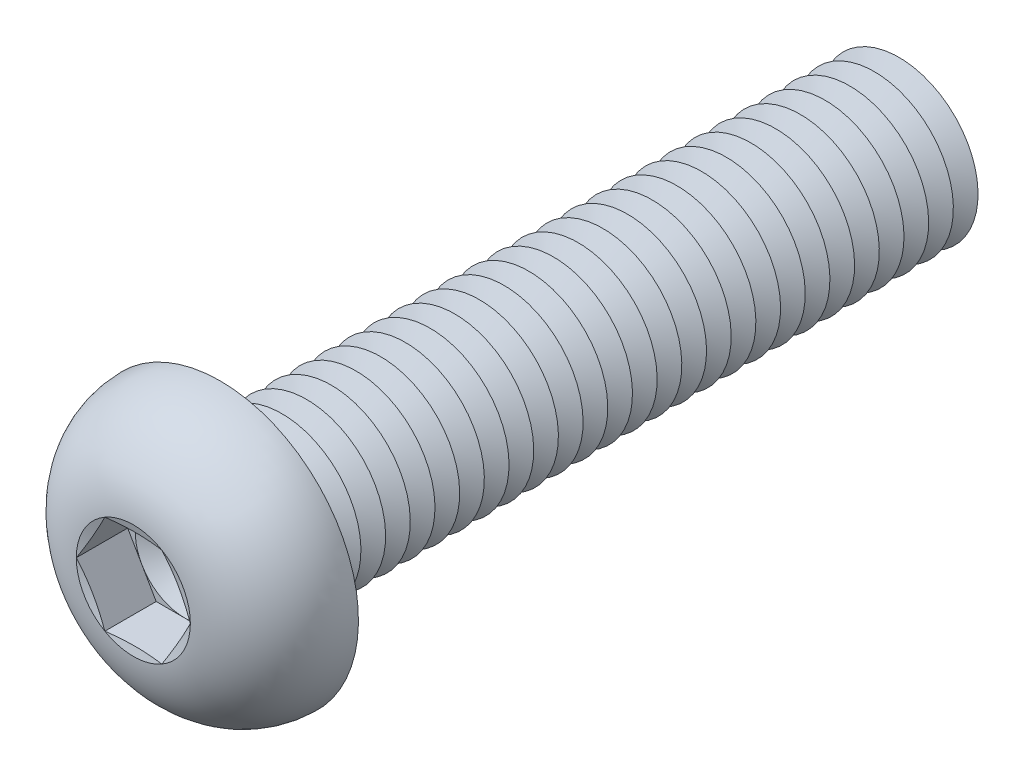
ISO-10303-21;
HEADER;
FILE_DESCRIPTION(('STEP AP214'),'2;1');
FILE_NAME('part.step','',(''),(''),'','','');
FILE_SCHEMA(('AUTOMOTIVE_DESIGN { 1 0 10303 214 1 1 1 1 }'));
ENDSEC;
DATA;
#1=APPLICATION_CONTEXT('core data for automotive mechanical design processes');
#2=APPLICATION_PROTOCOL_DEFINITION('international standard','automotive_design',2000,#1);
#3=PRODUCT_CONTEXT('',#1,'mechanical');
#4=PRODUCT('Part','Part','',(#3));
#5=PRODUCT_RELATED_PRODUCT_CATEGORY('part','',(#4));
#6=PRODUCT_DEFINITION_FORMATION('','',#4);
#7=PRODUCT_DEFINITION_CONTEXT('part definition',#1,'design');
#8=PRODUCT_DEFINITION('design','',#6,#7);
#9=PRODUCT_DEFINITION_SHAPE('','',#8);
#10=(LENGTH_UNIT() NAMED_UNIT(*) SI_UNIT(.MILLI.,.METRE.));
#11=(NAMED_UNIT(*) PLANE_ANGLE_UNIT() SI_UNIT($,.RADIAN.));
#12=(NAMED_UNIT(*) SI_UNIT($,.STERADIAN.) SOLID_ANGLE_UNIT());
#13=UNCERTAINTY_MEASURE_WITH_UNIT(LENGTH_MEASURE(1.E-05),#10,'distance_accuracy_value','');
#14=(GEOMETRIC_REPRESENTATION_CONTEXT(3) GLOBAL_UNCERTAINTY_ASSIGNED_CONTEXT((#13)) GLOBAL_UNIT_ASSIGNED_CONTEXT((#10,
#11,#12)) REPRESENTATION_CONTEXT('',''));
#15=CARTESIAN_POINT('',(0.,0.,0.));
#16=DIRECTION('',(0.,0.,1.));
#17=DIRECTION('',(1.,0.,0.));
#18=AXIS2_PLACEMENT_3D('',#15,#16,#17);
#19=CARTESIAN_POINT('',(0.,0.,1.8));
#20=DIRECTION('',(0.,0.,1.));
#21=DIRECTION('',(1.,0.,0.));
#22=AXIS2_PLACEMENT_3D('',#19,#20,#21);
#23=PLANE('',#22);
#24=CARTESIAN_POINT('',(0.,0.,1.8));
#25=DIRECTION('',(0.,0.,1.));
#26=DIRECTION('',(1.,0.,0.));
#27=AXIS2_PLACEMENT_3D('',#24,#25,#26);
#28=CIRCLE('',#27,2.49999883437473);
#29=CARTESIAN_POINT('',(2.1650625,1.24999941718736,1.8));
#30=VERTEX_POINT('',#29);
#31=CARTESIAN_POINT('',(0.,2.49999883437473,1.8));
#32=VERTEX_POINT('',#31);
#33=EDGE_CURVE('E118',#30,#32,#28,.T.);
#34=ORIENTED_EDGE('',*,*,#33,.F.);
#35=DIRECTION('',(-0.5,0.866025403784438,0.));
#36=VECTOR('',#35,1.);
#37=CARTESIAN_POINT('',(2.88675,0.,1.8));
#38=LINE('',#37,#36);
#39=CARTESIAN_POINT('',(1.443375,2.49999883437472,1.8));
#40=VERTEX_POINT('',#39);
#41=EDGE_CURVE('E125',#30,#40,#38,.T.);
#42=ORIENTED_EDGE('',*,*,#41,.T.);
#43=DIRECTION('',(-1.,0.,0.));
#44=VECTOR('',#43,1.);
#45=CARTESIAN_POINT('',(1.443375,2.49999883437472,1.8));
#46=LINE('',#45,#44);
#47=EDGE_CURVE('E136',#40,#32,#46,.T.);
#48=ORIENTED_EDGE('',*,*,#47,.T.);
#49=EDGE_LOOP('',(#34,#42,#48));
#50=FACE_BOUND('',#49,.T.);
#51=ADVANCED_FACE('F39',(#50),#23,.T.);
#52=CARTESIAN_POINT('',(0.,0.,1.8));
#53=DIRECTION('',(0.,0.,1.));
#54=DIRECTION('',(1.,0.,0.));
#55=AXIS2_PLACEMENT_3D('',#52,#53,#54);
#56=CIRCLE('',#55,2.49999883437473);
#57=CARTESIAN_POINT('',(-2.1650625,1.24999941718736,1.8));
#58=VERTEX_POINT('',#57);
#59=EDGE_CURVE('E11',#32,#58,#56,.T.);
#60=ORIENTED_EDGE('',*,*,#59,.F.);
#61=CARTESIAN_POINT('',(-1.443375,2.49999883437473,1.8));
#62=VERTEX_POINT('',#61);
#63=EDGE_CURVE('E131',#32,#62,#46,.T.);
#64=ORIENTED_EDGE('',*,*,#63,.T.);
#65=DIRECTION('',(-0.5,-0.866025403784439,0.));
#66=VECTOR('',#65,1.);
#67=CARTESIAN_POINT('',(-1.443375,2.49999883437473,1.8));
#68=LINE('',#67,#66);
#69=EDGE_CURVE('E134',#62,#58,#68,.T.);
#70=ORIENTED_EDGE('',*,*,#69,.T.);
#71=EDGE_LOOP('',(#60,#64,#70));
#72=FACE_BOUND('',#71,.T.);
#73=ADVANCED_FACE('F130',(#72),#23,.T.);
#74=CARTESIAN_POINT('',(-2.1650625,-1.24999941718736,1.8));
#75=VERTEX_POINT('',#74);
#76=EDGE_CURVE('E49',#58,#75,#56,.T.);
#77=ORIENTED_EDGE('',*,*,#76,.F.);
#78=CARTESIAN_POINT('',(-2.88675,0.,1.8));
#79=VERTEX_POINT('',#78);
#80=EDGE_CURVE('E143',#58,#79,#68,.T.);
#81=ORIENTED_EDGE('',*,*,#80,.T.);
#82=DIRECTION('',(0.5,-0.866025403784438,0.));
#83=VECTOR('',#82,1.);
#84=CARTESIAN_POINT('',(-2.88675,0.,1.8));
#85=LINE('',#84,#83);
#86=EDGE_CURVE('E152',#79,#75,#85,.T.);
#87=ORIENTED_EDGE('',*,*,#86,.T.);
#88=EDGE_LOOP('',(#77,#81,#87));
#89=FACE_BOUND('',#88,.T.);
#90=ADVANCED_FACE('F491',(#89),#23,.T.);
#91=CARTESIAN_POINT('',(0.,-2.49999883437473,1.8));
#92=VERTEX_POINT('',#91);
#93=EDGE_CURVE('E476',#75,#92,#56,.T.);
#94=ORIENTED_EDGE('',*,*,#93,.F.);
#95=CARTESIAN_POINT('',(-1.443375,-2.49999883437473,1.8));
#96=VERTEX_POINT('',#95);
#97=EDGE_CURVE('E151',#75,#96,#85,.T.);
#98=ORIENTED_EDGE('',*,*,#97,.T.);
#99=DIRECTION('',(1.,0.,0.));
#100=VECTOR('',#99,1.);
#101=CARTESIAN_POINT('',(-1.443375,-2.49999883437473,1.8));
#102=LINE('',#101,#100);
#103=EDGE_CURVE('E157',#96,#92,#102,.T.);
#104=ORIENTED_EDGE('',*,*,#103,.T.);
#105=EDGE_LOOP('',(#94,#98,#104));
#106=FACE_BOUND('',#105,.T.);
#107=ADVANCED_FACE('F484',(#106),#23,.T.);
#108=CARTESIAN_POINT('',(2.1650625,-1.24999941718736,1.8));
#109=VERTEX_POINT('',#108);
#110=EDGE_CURVE('E56',#92,#109,#56,.T.);
#111=ORIENTED_EDGE('',*,*,#110,.F.);
#112=CARTESIAN_POINT('',(1.443375,-2.49999883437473,1.8));
#113=VERTEX_POINT('',#112);
#114=EDGE_CURVE('E156',#92,#113,#102,.T.);
#115=ORIENTED_EDGE('',*,*,#114,.T.);
#116=DIRECTION('',(0.5,0.866025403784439,0.));
#117=VECTOR('',#116,1.);
#118=CARTESIAN_POINT('',(1.443375,-2.49999883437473,1.8));
#119=LINE('',#118,#117);
#120=EDGE_CURVE('E162',#113,#109,#119,.T.);
#121=ORIENTED_EDGE('',*,*,#120,.T.);
#122=EDGE_LOOP('',(#111,#115,#121));
#123=FACE_BOUND('',#122,.T.);
#124=ADVANCED_FACE('F562',(#123),#23,.T.);
#125=CARTESIAN_POINT('',(0.,0.,4.4));
#126=DIRECTION('',(0.,0.,1.));
#127=DIRECTION('',(0.,-1.,0.));
#128=AXIS2_PLACEMENT_3D('',#125,#126,#127);
#129=CONICAL_SURFACE('',#128,2.88675,1.30899693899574);
#130=CARTESIAN_POINT('',(2.88686547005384,-0.000200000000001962,4.40003094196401));
#131=CARTESIAN_POINT('',(2.82691617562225,0.103635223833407,4.3839595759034));
#132=CARTESIAN_POINT('',(2.76685817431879,0.20765873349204,4.36936933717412));
#133=CARTESIAN_POINT('',(2.64653003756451,0.416073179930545,4.3437355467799));
#134=CARTESIAN_POINT('',(2.58625982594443,0.520464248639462,4.33269343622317));
#135=CARTESIAN_POINT('',(2.46587274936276,0.72898078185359,4.31480063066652));
#136=CARTESIAN_POINT('',(2.40575669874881,0.833104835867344,4.3079285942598));
#137=CARTESIAN_POINT('',(2.28544792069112,1.04148575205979,4.29871388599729));
#138=CARTESIAN_POINT('',(2.22525521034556,1.14574258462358,4.29637033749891));
#139=CARTESIAN_POINT('',(2.10486978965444,1.35425624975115,4.29637033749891));
#140=CARTESIAN_POINT('',(2.04467707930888,1.45851308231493,4.29871388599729));
#141=CARTESIAN_POINT('',(1.92436830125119,1.66689399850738,4.3079285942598));
#142=CARTESIAN_POINT('',(1.86425225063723,1.77101805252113,4.31480063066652));
#143=CARTESIAN_POINT('',(1.74386517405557,1.97953458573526,4.33269343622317));
#144=CARTESIAN_POINT('',(1.68359496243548,2.08392565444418,4.3437355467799));
#145=CARTESIAN_POINT('',(1.56326682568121,2.29234010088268,4.36936933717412));
#146=CARTESIAN_POINT('',(1.50320882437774,2.39636361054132,4.3839595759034));
#147=CARTESIAN_POINT('',(1.44325952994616,2.50019883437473,4.40003094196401));
#148=B_SPLINE_CURVE_WITH_KNOTS('',3,(#130,#131,#132,#133,#134,#135,#136,#137,#138,#139,#140,
#141,#142,#143,#144,#145,#146,#147),.UNSPECIFIED.,.F.,.F.,(4,2,2,2,2,2,2,2,4),(0.,
0.362931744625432,0.726010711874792,1.08721550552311,1.44835036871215,1.80948523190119,
2.17069002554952,2.53376899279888,2.89670073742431),.UNSPECIFIED.);
#149=CARTESIAN_POINT('',(2.88675,0.,4.4));
#150=VERTEX_POINT('',#149);
#151=CARTESIAN_POINT('',(1.443375,2.49999883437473,4.4));
#152=VERTEX_POINT('',#151);
#153=EDGE_CURVE('E221',#150,#152,#148,.T.);
#154=ORIENTED_EDGE('',*,*,#153,.F.);
#155=CARTESIAN_POINT('',(0.,0.,4.4));
#156=DIRECTION('',(0.,0.,-1.));
#157=DIRECTION('',(0.,1.,0.));
#158=AXIS2_PLACEMENT_3D('',#155,#156,#157);
#159=CIRCLE('',#158,2.88675);
#160=EDGE_CURVE('E461',#152,#150,#159,.T.);
#161=ORIENTED_EDGE('',*,*,#160,.F.);
#162=EDGE_LOOP('',(#154,#161));
#163=FACE_BOUND('',#162,.T.);
#164=ADVANCED_FACE('F566',(#163),#129,.F.);
#165=CARTESIAN_POINT('',(1.44325952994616,-2.50019883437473,4.40003094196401));
#166=CARTESIAN_POINT('',(1.50320882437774,-2.39636361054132,4.3839595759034));
#167=CARTESIAN_POINT('',(1.56326682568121,-2.29234010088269,4.36936933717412));
#168=CARTESIAN_POINT('',(1.68359496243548,-2.08392565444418,4.3437355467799));
#169=CARTESIAN_POINT('',(1.74386517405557,-1.97953458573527,4.33269343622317));
#170=CARTESIAN_POINT('',(1.86425225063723,-1.77101805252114,4.31480063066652));
#171=CARTESIAN_POINT('',(1.92436830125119,-1.66689399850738,4.3079285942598));
#172=CARTESIAN_POINT('',(2.04467707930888,-1.45851308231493,4.29871388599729));
#173=CARTESIAN_POINT('',(2.10486978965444,-1.35425624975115,4.29637033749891));
#174=CARTESIAN_POINT('',(2.22525521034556,-1.14574258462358,4.29637033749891));
#175=CARTESIAN_POINT('',(2.28544792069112,-1.0414857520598,4.29871388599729));
#176=CARTESIAN_POINT('',(2.40575669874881,-0.833104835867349,4.3079285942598));
#177=CARTESIAN_POINT('',(2.46587274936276,-0.728980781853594,4.31480063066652));
#178=CARTESIAN_POINT('',(2.58625982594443,-0.520464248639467,4.33269343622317));
#179=CARTESIAN_POINT('',(2.64653003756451,-0.41607317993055,4.3437355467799));
#180=CARTESIAN_POINT('',(2.76685817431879,-0.207658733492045,4.36936933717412));
#181=CARTESIAN_POINT('',(2.82691617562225,-0.103635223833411,4.3839595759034));
#182=CARTESIAN_POINT('',(2.88686547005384,0.000199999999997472,4.40003094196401));
#183=B_SPLINE_CURVE_WITH_KNOTS('',3,(#165,#166,#167,#168,#169,#170,#171,#172,#173,#174,#175,
#176,#177,#178,#179,#180,#181,#182),.UNSPECIFIED.,.F.,.F.,(4,2,2,2,2,2,2,2,4),(0.,
0.362931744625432,0.726010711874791,1.08721550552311,1.44835036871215,1.80948523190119,
2.17069002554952,2.53376899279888,2.89670073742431),.UNSPECIFIED.);
#184=CARTESIAN_POINT('',(1.443375,-2.49999883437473,4.4));
#185=VERTEX_POINT('',#184);
#186=EDGE_CURVE('E230',#185,#150,#183,.T.);
#187=ORIENTED_EDGE('',*,*,#186,.F.);
#188=EDGE_CURVE('E466',#150,#185,#159,.T.);
#189=ORIENTED_EDGE('',*,*,#188,.F.);
#190=EDGE_LOOP('',(#187,#189));
#191=FACE_BOUND('',#190,.T.);
#192=ADVANCED_FACE('F528',(#191),#129,.F.);
#193=CARTESIAN_POINT('',(-4.35611719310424,-2.49999883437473,4.97227902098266));
#194=CARTESIAN_POINT('',(-4.25066509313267,-2.49999883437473,4.94777440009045));
#195=CARTESIAN_POINT('',(-4.14516541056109,-2.49999883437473,4.92347459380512));
#196=CARTESIAN_POINT('',(-3.93405094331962,-2.49999883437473,4.87537247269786));
#197=CARTESIAN_POINT('',(-3.82843615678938,-2.49999883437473,4.85157016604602));
#198=CARTESIAN_POINT('',(-3.5113534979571,-2.49999883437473,4.78103338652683));
#199=CARTESIAN_POINT('',(-3.29968815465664,-2.49999883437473,4.73517861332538));
#200=CARTESIAN_POINT('',(-2.87365524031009,-2.49999883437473,4.64645582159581));
#201=CARTESIAN_POINT('',(-2.65928093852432,-2.49999883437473,4.60361983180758));
#202=CARTESIAN_POINT('',(-2.22952626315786,-2.49999883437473,4.52311285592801));
#203=CARTESIAN_POINT('',(-2.01414580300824,-2.49999883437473,4.48544232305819));
#204=CARTESIAN_POINT('',(-1.58798319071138,-2.49999883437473,4.41876559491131));
#205=CARTESIAN_POINT('',(-1.37723418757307,-2.49999883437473,4.38955265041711));
#206=CARTESIAN_POINT('',(-0.954530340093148,-2.49999883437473,4.34171384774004));
#207=CARTESIAN_POINT('',(-0.742575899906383,-2.49999883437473,4.32308463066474));
#208=CARTESIAN_POINT('',(-0.424544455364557,-2.49999883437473,4.30539140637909));
#209=CARTESIAN_POINT('',(-0.318745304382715,-2.49999883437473,4.30120018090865));
#210=CARTESIAN_POINT('',(-0.107062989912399,-2.49999883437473,4.29638997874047));
#211=CARTESIAN_POINT('',(-0.00117982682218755,-2.49999883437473,4.29577098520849));
#212=CARTESIAN_POINT('',(0.210552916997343,-2.49999883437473,4.29814378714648));
#213=CARTESIAN_POINT('',(0.316402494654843,-2.49999883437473,4.30113585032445));
#214=CARTESIAN_POINT('',(0.527944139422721,-2.49999883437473,4.31057322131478));
#215=CARTESIAN_POINT('',(0.633636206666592,-2.49999883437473,4.31701852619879));
#216=CARTESIAN_POINT('',(0.890304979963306,-2.49999883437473,4.33652018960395));
#217=CARTESIAN_POINT('',(1.0411561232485,-2.49999883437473,4.35122885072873));
#218=CARTESIAN_POINT('',(1.34222474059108,-2.49999883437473,4.38593609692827));
#219=CARTESIAN_POINT('',(1.49244223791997,-2.49999883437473,4.40593448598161));
#220=CARTESIAN_POINT('',(1.79273634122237,-2.49999883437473,4.45011321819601));
#221=CARTESIAN_POINT('',(1.94281100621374,-2.49999883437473,4.47430656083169));
#222=CARTESIAN_POINT('',(2.24242097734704,-2.49999883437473,4.52583552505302));
#223=CARTESIAN_POINT('',(2.39195625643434,-2.49999883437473,4.55317130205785));
#224=CARTESIAN_POINT('',(2.69364402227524,-2.49999883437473,4.61079781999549));
#225=CARTESIAN_POINT('',(2.8457870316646,-2.49999883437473,4.64113779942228));
#226=CARTESIAN_POINT('',(3.14969016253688,-2.49999883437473,4.70367638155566));
#227=CARTESIAN_POINT('',(3.30145027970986,-2.49999883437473,4.73587500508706));
#228=CARTESIAN_POINT('',(3.60383766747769,-2.49999883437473,4.80150275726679));
#229=CARTESIAN_POINT('',(3.75446660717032,-2.49999883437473,4.83492423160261));
#230=CARTESIAN_POINT('',(4.05546753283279,-2.49999883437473,4.90285814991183));
#231=CARTESIAN_POINT('',(4.2058395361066,-2.49999883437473,4.9373705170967));
#232=CARTESIAN_POINT('',(4.35611719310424,-2.49999883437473,4.97227902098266));
#233=B_SPLINE_CURVE_WITH_KNOTS('',3,(#193,#194,#195,#196,#197,#198,#199,#200,#201,#202,#203,
#204,#205,#206,#207,#208,#209,#210,#211,#212,#213,#214,#215,#216,#217,#218,#219,#220,#221,#222,
#223,#224,#225,#226,#227,#228,#229,#230,#231,#232),.UNSPECIFIED.,.F.,.F.,(4,2,2,2,2,2,2,2,2,2,2,
2,2,2,2,2,2,2,2,4),(0.,0.324785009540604,0.6495753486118,1.29928181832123,1.95507889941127,
2.61093348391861,3.24905289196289,3.88696967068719,4.204563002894,4.5221548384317,
4.83977022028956,5.15738533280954,5.61196030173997,6.06651842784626,6.52251118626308,
6.97852650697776,7.44392737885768,7.90933346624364,8.37220553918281,8.83504510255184),.UNSPECIFIED.);
#234=CARTESIAN_POINT('',(-1.443375,-2.49999883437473,4.4));
#235=VERTEX_POINT('',#234);
#236=EDGE_CURVE('E505',#235,#185,#233,.T.);
#237=ORIENTED_EDGE('',*,*,#236,.F.);
#238=EDGE_CURVE('E518',#185,#235,#159,.T.);
#239=ORIENTED_EDGE('',*,*,#238,.F.);
#240=EDGE_LOOP('',(#237,#239));
#241=FACE_BOUND('',#240,.T.);
#242=ADVANCED_FACE('F534',(#241),#129,.F.);
#243=CARTESIAN_POINT('',(-2.88686547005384,0.000199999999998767,4.40003094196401));
#244=CARTESIAN_POINT('',(-2.82691617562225,-0.103635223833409,4.3839595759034));
#245=CARTESIAN_POINT('',(-2.76685817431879,-0.207658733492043,4.36936933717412));
#246=CARTESIAN_POINT('',(-2.64653003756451,-0.416073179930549,4.3437355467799));
#247=CARTESIAN_POINT('',(-2.58625982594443,-0.520464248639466,4.33269343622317));
#248=CARTESIAN_POINT('',(-2.46587274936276,-0.728980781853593,4.31480063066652));
#249=CARTESIAN_POINT('',(-2.40575669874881,-0.833104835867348,4.3079285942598));
#250=CARTESIAN_POINT('',(-2.28544792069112,-1.0414857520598,4.29871388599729));
#251=CARTESIAN_POINT('',(-2.22525521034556,-1.14574258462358,4.29637033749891));
#252=CARTESIAN_POINT('',(-2.10486978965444,-1.35425624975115,4.29637033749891));
#253=CARTESIAN_POINT('',(-2.04467707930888,-1.45851308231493,4.29871388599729));
#254=CARTESIAN_POINT('',(-1.92436830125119,-1.66689399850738,4.3079285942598));
#255=CARTESIAN_POINT('',(-1.86425225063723,-1.77101805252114,4.31480063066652));
#256=CARTESIAN_POINT('',(-1.74386517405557,-1.97953458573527,4.33269343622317));
#257=CARTESIAN_POINT('',(-1.68359496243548,-2.08392565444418,4.3437355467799));
#258=CARTESIAN_POINT('',(-1.56326682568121,-2.29234010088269,4.36936933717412));
#259=CARTESIAN_POINT('',(-1.50320882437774,-2.39636361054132,4.3839595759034));
#260=CARTESIAN_POINT('',(-1.44325952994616,-2.50019883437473,4.40003094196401));
#261=B_SPLINE_CURVE_WITH_KNOTS('',3,(#243,#244,#245,#246,#247,#248,#249,#250,#251,#252,#253,
#254,#255,#256,#257,#258,#259,#260),.UNSPECIFIED.,.F.,.F.,(4,2,2,2,2,2,2,2,4),(0.,
0.362931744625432,0.726010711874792,1.08721550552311,1.44835036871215,1.80948523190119,
2.17069002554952,2.53376899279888,2.89670073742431),.UNSPECIFIED.);
#262=CARTESIAN_POINT('',(-2.88675,0.,4.4));
#263=VERTEX_POINT('',#262);
#264=EDGE_CURVE('E496',#263,#235,#261,.T.);
#265=ORIENTED_EDGE('',*,*,#264,.F.);
#266=EDGE_CURVE('E502',#235,#263,#159,.T.);
#267=ORIENTED_EDGE('',*,*,#266,.F.);
#268=EDGE_LOOP('',(#265,#267));
#269=FACE_BOUND('',#268,.T.);
#270=ADVANCED_FACE('F500',(#269),#129,.F.);
#271=CARTESIAN_POINT('',(-1.44325952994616,2.50019883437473,4.40003094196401));
#272=CARTESIAN_POINT('',(-1.50320882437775,2.39636361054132,4.3839595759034));
#273=CARTESIAN_POINT('',(-1.56326682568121,2.29234010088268,4.36936933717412));
#274=CARTESIAN_POINT('',(-1.68359496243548,2.08392565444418,4.3437355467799));
#275=CARTESIAN_POINT('',(-1.74386517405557,1.97953458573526,4.33269343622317));
#276=CARTESIAN_POINT('',(-1.86425225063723,1.77101805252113,4.31480063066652));
#277=CARTESIAN_POINT('',(-1.92436830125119,1.66689399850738,4.3079285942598));
#278=CARTESIAN_POINT('',(-2.04467707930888,1.45851308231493,4.29871388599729));
#279=CARTESIAN_POINT('',(-2.10486978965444,1.35425624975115,4.29637033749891));
#280=CARTESIAN_POINT('',(-2.22525521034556,1.14574258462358,4.29637033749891));
#281=CARTESIAN_POINT('',(-2.28544792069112,1.04148575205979,4.29871388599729));
#282=CARTESIAN_POINT('',(-2.40575669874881,0.833104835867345,4.3079285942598));
#283=CARTESIAN_POINT('',(-2.46587274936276,0.728980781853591,4.31480063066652));
#284=CARTESIAN_POINT('',(-2.58625982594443,0.520464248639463,4.33269343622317));
#285=CARTESIAN_POINT('',(-2.64653003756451,0.416073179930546,4.3437355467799));
#286=CARTESIAN_POINT('',(-2.76685817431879,0.207658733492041,4.36936933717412));
#287=CARTESIAN_POINT('',(-2.82691617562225,0.103635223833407,4.3839595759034));
#288=CARTESIAN_POINT('',(-2.88686547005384,-0.000200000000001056,4.40003094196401));
#289=B_SPLINE_CURVE_WITH_KNOTS('',3,(#271,#272,#273,#274,#275,#276,#277,#278,#279,#280,#281,
#282,#283,#284,#285,#286,#287,#288),.UNSPECIFIED.,.F.,.F.,(4,2,2,2,2,2,2,2,4),(0.,
0.362931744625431,0.72601071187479,1.08721550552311,1.44835036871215,1.80948523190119,
2.17069002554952,2.53376899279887,2.89670073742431),.UNSPECIFIED.);
#290=CARTESIAN_POINT('',(-1.443375,2.49999883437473,4.4));
#291=VERTEX_POINT('',#290);
#292=EDGE_CURVE('E195',#291,#263,#289,.T.);
#293=ORIENTED_EDGE('',*,*,#292,.F.);
#294=EDGE_CURVE('E508',#263,#291,#159,.T.);
#295=ORIENTED_EDGE('',*,*,#294,.F.);
#296=EDGE_LOOP('',(#293,#295));
#297=FACE_BOUND('',#296,.T.);
#298=ADVANCED_FACE('F509',(#297),#129,.F.);
#299=CARTESIAN_POINT('',(0.,0.,-30.625));
#300=DIRECTION('',(0.,0.,1.));
#301=DIRECTION('',(0.,-1.,0.));
#302=AXIS2_PLACEMENT_3D('',#299,#300,#301);
#303=CONICAL_SURFACE('',#302,3.99999999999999,1.0471975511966);
#304=CARTESIAN_POINT('',(0.,0.,-31.25));
#305=DIRECTION('',(0.,0.,1.));
#306=DIRECTION('',(0.,-1.,0.));
#307=AXIS2_PLACEMENT_3D('',#304,#305,#306);
#308=CIRCLE('',#307,2.91746824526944);
#309=CARTESIAN_POINT('',(0.,-2.91746824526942,-31.25));
#310=VERTEX_POINT('',#309);
#311=EDGE_CURVE('E432',#310,#310,#308,.T.);
#312=ORIENTED_EDGE('',*,*,#311,.T.);
#313=EDGE_LOOP('',(#312));
#314=FACE_BOUND('',#313,.T.);
#315=CARTESIAN_POINT('',(0.,0.,-30.625));
#316=DIRECTION('',(0.,0.,1.));
#317=DIRECTION('',(0.,-1.,0.));
#318=AXIS2_PLACEMENT_3D('',#315,#316,#317);
#319=CIRCLE('',#318,3.99999999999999);
#320=CARTESIAN_POINT('',(0.,-3.99999999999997,-30.625));
#321=VERTEX_POINT('',#320);
#322=EDGE_CURVE('E428',#321,#321,#319,.T.);
#323=ORIENTED_EDGE('',*,*,#322,.F.);
#324=EDGE_LOOP('',(#323));
#325=FACE_BOUND('',#324,.T.);
#326=ADVANCED_FACE('F593',(#314,#325),#303,.T.);
#327=CARTESIAN_POINT('',(0.,0.,-31.25));
#328=DIRECTION('',(0.,0.,-1.));
#329=DIRECTION('',(0.,1.,0.));
#330=AXIS2_PLACEMENT_3D('',#327,#328,#329);
#331=CONICAL_SURFACE('',#330,2.91746824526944,1.0471975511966);
#332=CARTESIAN_POINT('',(0.,0.,-31.875));
#333=DIRECTION('',(0.,0.,1.));
#334=DIRECTION('',(0.,-1.,0.));
#335=AXIS2_PLACEMENT_3D('',#332,#333,#334);
#336=CIRCLE('',#335,3.99999999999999);
#337=CARTESIAN_POINT('',(0.,-3.99999999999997,-31.875));
#338=VERTEX_POINT('',#337);
#339=EDGE_CURVE('E436',#338,#338,#336,.T.);
#340=ORIENTED_EDGE('',*,*,#339,.T.);
#341=EDGE_LOOP('',(#340));
#342=FACE_BOUND('',#341,.T.);
#343=ORIENTED_EDGE('',*,*,#311,.F.);
#344=EDGE_LOOP('',(#343));
#345=FACE_BOUND('',#344,.T.);
#346=ADVANCED_FACE('F598',(#342,#345),#331,.T.);
#347=CARTESIAN_POINT('',(0.,4.,-35.));
#348=DIRECTION('',(0.,0.,-1.));
#349=DIRECTION('',(0.,1.,0.));
#350=AXIS2_PLACEMENT_3D('',#347,#348,#349);
#351=PLANE('',#350);
#352=CARTESIAN_POINT('',(0.,0.,-35.));
#353=DIRECTION('',(0.,0.,1.));
#354=DIRECTION('',(0.,-1.,0.));
#355=AXIS2_PLACEMENT_3D('',#352,#353,#354);
#356=CIRCLE('',#355,2.91746824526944);
#357=CARTESIAN_POINT('',(0.,-2.91746824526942,-35.));
#358=VERTEX_POINT('',#357);
#359=EDGE_CURVE('E456',#358,#358,#356,.T.);
#360=ORIENTED_EDGE('',*,*,#359,.F.);
#361=EDGE_LOOP('',(#360));
#362=FACE_BOUND('',#361,.T.);
#363=ADVANCED_FACE('F765',(#362),#351,.T.);
#364=CARTESIAN_POINT('',(0.,0.,-34.375));
#365=DIRECTION('',(0.,0.,1.));
#366=DIRECTION('',(0.,-1.,0.));
#367=AXIS2_PLACEMENT_3D('',#364,#365,#366);
#368=CONICAL_SURFACE('',#367,3.99999999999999,1.0471975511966);
#369=ORIENTED_EDGE('',*,*,#359,.T.);
#370=EDGE_LOOP('',(#369));
#371=FACE_BOUND('',#370,.T.);
#372=CARTESIAN_POINT('',(0.,0.,-34.375));
#373=DIRECTION('',(0.,0.,1.));
#374=DIRECTION('',(0.,-1.,0.));
#375=AXIS2_PLACEMENT_3D('',#372,#373,#374);
#376=CIRCLE('',#375,3.99999999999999);
#377=CARTESIAN_POINT('',(0.,-3.99999999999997,-34.375));
#378=VERTEX_POINT('',#377);
#379=EDGE_CURVE('E452',#378,#378,#376,.T.);
#380=ORIENTED_EDGE('',*,*,#379,.F.);
#381=EDGE_LOOP('',(#380));
#382=FACE_BOUND('',#381,.T.);
#383=ADVANCED_FACE('F758',(#371,#382),#368,.T.);
#384=CARTESIAN_POINT('',(0.,0.,-33.75));
#385=DIRECTION('',(0.,0.,-1.));
#386=DIRECTION('',(0.,1.,0.));
#387=AXIS2_PLACEMENT_3D('',#384,#385,#386);
#388=CONICAL_SURFACE('',#387,2.91746824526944,1.0471975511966);
#389=ORIENTED_EDGE('',*,*,#379,.T.);
#390=EDGE_LOOP('',(#389));
#391=FACE_BOUND('',#390,.T.);
#392=CARTESIAN_POINT('',(0.,0.,-33.75));
#393=DIRECTION('',(0.,0.,1.));
#394=DIRECTION('',(0.,-1.,0.));
#395=AXIS2_PLACEMENT_3D('',#392,#393,#394);
#396=CIRCLE('',#395,2.91746824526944);
#397=CARTESIAN_POINT('',(0.,-2.91746824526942,-33.75));
#398=VERTEX_POINT('',#397);
#399=EDGE_CURVE('E448',#398,#398,#396,.T.);
#400=ORIENTED_EDGE('',*,*,#399,.F.);
#401=EDGE_LOOP('',(#400));
#402=FACE_BOUND('',#401,.T.);
#403=ADVANCED_FACE('F764',(#391,#402),#388,.T.);
#404=CARTESIAN_POINT('',(0.,0.,-33.125));
#405=DIRECTION('',(0.,0.,1.));
#406=DIRECTION('',(0.,-1.,0.));
#407=AXIS2_PLACEMENT_3D('',#404,#405,#406);
#408=CONICAL_SURFACE('',#407,3.99999999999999,1.0471975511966);
#409=ORIENTED_EDGE('',*,*,#399,.T.);
#410=EDGE_LOOP('',(#409));
#411=FACE_BOUND('',#410,.T.);
#412=CARTESIAN_POINT('',(0.,0.,-33.125));
#413=DIRECTION('',(0.,0.,1.));
#414=DIRECTION('',(0.,-1.,0.));
#415=AXIS2_PLACEMENT_3D('',#412,#413,#414);
#416=CIRCLE('',#415,3.99999999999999);
#417=CARTESIAN_POINT('',(0.,-3.99999999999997,-33.125));
#418=VERTEX_POINT('',#417);
#419=EDGE_CURVE('E444',#418,#418,#416,.T.);
#420=ORIENTED_EDGE('',*,*,#419,.F.);
#421=EDGE_LOOP('',(#420));
#422=FACE_BOUND('',#421,.T.);
#423=ADVANCED_FACE('F796',(#411,#422),#408,.T.);
#424=CARTESIAN_POINT('',(0.,0.,-32.5));
#425=DIRECTION('',(0.,0.,-1.));
#426=DIRECTION('',(0.,1.,0.));
#427=AXIS2_PLACEMENT_3D('',#424,#425,#426);
#428=CONICAL_SURFACE('',#427,2.91746824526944,1.0471975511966);
#429=ORIENTED_EDGE('',*,*,#419,.T.);
#430=EDGE_LOOP('',(#429));
#431=FACE_BOUND('',#430,.T.);
#432=CARTESIAN_POINT('',(0.,0.,-32.5));
#433=DIRECTION('',(0.,0.,1.));
#434=DIRECTION('',(0.,-1.,0.));
#435=AXIS2_PLACEMENT_3D('',#432,#433,#434);
#436=CIRCLE('',#435,2.91746824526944);
#437=CARTESIAN_POINT('',(0.,-2.91746824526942,-32.5));
#438=VERTEX_POINT('',#437);
#439=EDGE_CURVE('E440',#438,#438,#436,.T.);
#440=ORIENTED_EDGE('',*,*,#439,.F.);
#441=EDGE_LOOP('',(#440));
#442=FACE_BOUND('',#441,.T.);
#443=ADVANCED_FACE('F806',(#431,#442),#428,.T.);
#444=CARTESIAN_POINT('',(0.,0.,-31.875));
#445=DIRECTION('',(0.,0.,1.));
#446=DIRECTION('',(0.,-1.,0.));
#447=AXIS2_PLACEMENT_3D('',#444,#445,#446);
#448=CONICAL_SURFACE('',#447,3.99999999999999,1.0471975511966);
#449=ORIENTED_EDGE('',*,*,#439,.T.);
#450=EDGE_LOOP('',(#449));
#451=FACE_BOUND('',#450,.T.);
#452=ORIENTED_EDGE('',*,*,#339,.F.);
#453=EDGE_LOOP('',(#452));
#454=FACE_BOUND('',#453,.T.);
#455=ADVANCED_FACE('F816',(#451,#454),#448,.T.);
#456=CARTESIAN_POINT('',(0.,0.,-29.375));
#457=DIRECTION('',(0.,0.,1.));
#458=DIRECTION('',(0.,-1.,0.));
#459=AXIS2_PLACEMENT_3D('',#456,#457,#458);
#460=CONICAL_SURFACE('',#459,3.99999999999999,1.0471975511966);
#461=CARTESIAN_POINT('',(0.,0.,-30.));
#462=DIRECTION('',(0.,0.,1.));
#463=DIRECTION('',(0.,-1.,0.));
#464=AXIS2_PLACEMENT_3D('',#461,#462,#463);
#465=CIRCLE('',#464,2.91746824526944);
#466=CARTESIAN_POINT('',(0.,-2.91746824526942,-30.));
#467=VERTEX_POINT('',#466);
#468=EDGE_CURVE('E424',#467,#467,#465,.T.);
#469=ORIENTED_EDGE('',*,*,#468,.T.);
#470=EDGE_LOOP('',(#469));
#471=FACE_BOUND('',#470,.T.);
#472=CARTESIAN_POINT('',(0.,0.,-29.375));
#473=DIRECTION('',(0.,0.,1.));
#474=DIRECTION('',(0.,-1.,0.));
#475=AXIS2_PLACEMENT_3D('',#472,#473,#474);
#476=CIRCLE('',#475,3.99999999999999);
#477=CARTESIAN_POINT('',(0.,-3.99999999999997,-29.375));
#478=VERTEX_POINT('',#477);
#479=EDGE_CURVE('E420',#478,#478,#476,.T.);
#480=ORIENTED_EDGE('',*,*,#479,.F.);
#481=EDGE_LOOP('',(#480));
#482=FACE_BOUND('',#481,.T.);
#483=ADVANCED_FACE('F826',(#471,#482),#460,.T.);
#484=CARTESIAN_POINT('',(0.,0.,-30.));
#485=DIRECTION('',(0.,0.,-1.));
#486=DIRECTION('',(0.,1.,0.));
#487=AXIS2_PLACEMENT_3D('',#484,#485,#486);
#488=CONICAL_SURFACE('',#487,2.91746824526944,1.0471975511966);
#489=ORIENTED_EDGE('',*,*,#322,.T.);
#490=EDGE_LOOP('',(#489));
#491=FACE_BOUND('',#490,.T.);
#492=ORIENTED_EDGE('',*,*,#468,.F.);
#493=EDGE_LOOP('',(#492));
#494=FACE_BOUND('',#493,.T.);
#495=ADVANCED_FACE('F836',(#491,#494),#488,.T.);
#496=CARTESIAN_POINT('',(0.,0.,-28.125));
#497=DIRECTION('',(0.,0.,1.));
#498=DIRECTION('',(0.,-1.,0.));
#499=AXIS2_PLACEMENT_3D('',#496,#497,#498);
#500=CONICAL_SURFACE('',#499,3.99999999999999,1.0471975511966);
#501=CARTESIAN_POINT('',(0.,0.,-28.75));
#502=DIRECTION('',(0.,0.,1.));
#503=DIRECTION('',(0.,-1.,0.));
#504=AXIS2_PLACEMENT_3D('',#501,#502,#503);
#505=CIRCLE('',#504,2.91746824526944);
#506=CARTESIAN_POINT('',(0.,-2.91746824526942,-28.75));
#507=VERTEX_POINT('',#506);
#508=EDGE_CURVE('E416',#507,#507,#505,.T.);
#509=ORIENTED_EDGE('',*,*,#508,.T.);
#510=EDGE_LOOP('',(#509));
#511=FACE_BOUND('',#510,.T.);
#512=CARTESIAN_POINT('',(0.,0.,-28.125));
#513=DIRECTION('',(0.,0.,1.));
#514=DIRECTION('',(0.,-1.,0.));
#515=AXIS2_PLACEMENT_3D('',#512,#513,#514);
#516=CIRCLE('',#515,3.99999999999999);
#517=CARTESIAN_POINT('',(0.,-3.99999999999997,-28.125));
#518=VERTEX_POINT('',#517);
#519=EDGE_CURVE('E412',#518,#518,#516,.T.);
#520=ORIENTED_EDGE('',*,*,#519,.F.);
#521=EDGE_LOOP('',(#520));
#522=FACE_BOUND('',#521,.T.);
#523=ADVANCED_FACE('F846',(#511,#522),#500,.T.);
#524=CARTESIAN_POINT('',(0.,0.,-28.75));
#525=DIRECTION('',(0.,0.,-1.));
#526=DIRECTION('',(0.,1.,0.));
#527=AXIS2_PLACEMENT_3D('',#524,#525,#526);
#528=CONICAL_SURFACE('',#527,2.91746824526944,1.0471975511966);
#529=ORIENTED_EDGE('',*,*,#479,.T.);
#530=EDGE_LOOP('',(#529));
#531=FACE_BOUND('',#530,.T.);
#532=ORIENTED_EDGE('',*,*,#508,.F.);
#533=EDGE_LOOP('',(#532));
#534=FACE_BOUND('',#533,.T.);
#535=ADVANCED_FACE('F856',(#531,#534),#528,.T.);
#536=CARTESIAN_POINT('',(0.,0.,-26.875));
#537=DIRECTION('',(0.,0.,1.));
#538=DIRECTION('',(0.,-1.,0.));
#539=AXIS2_PLACEMENT_3D('',#536,#537,#538);
#540=CONICAL_SURFACE('',#539,3.99999999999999,1.0471975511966);
#541=CARTESIAN_POINT('',(0.,0.,-27.5));
#542=DIRECTION('',(0.,0.,1.));
#543=DIRECTION('',(0.,-1.,0.));
#544=AXIS2_PLACEMENT_3D('',#541,#542,#543);
#545=CIRCLE('',#544,2.91746824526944);
#546=CARTESIAN_POINT('',(0.,-2.91746824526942,-27.5));
#547=VERTEX_POINT('',#546);
#548=EDGE_CURVE('E408',#547,#547,#545,.T.);
#549=ORIENTED_EDGE('',*,*,#548,.T.);
#550=EDGE_LOOP('',(#549));
#551=FACE_BOUND('',#550,.T.);
#552=CARTESIAN_POINT('',(0.,0.,-26.875));
#553=DIRECTION('',(0.,0.,1.));
#554=DIRECTION('',(0.,-1.,0.));
#555=AXIS2_PLACEMENT_3D('',#552,#553,#554);
#556=CIRCLE('',#555,3.99999999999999);
#557=CARTESIAN_POINT('',(0.,-3.99999999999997,-26.875));
#558=VERTEX_POINT('',#557);
#559=EDGE_CURVE('E404',#558,#558,#556,.T.);
#560=ORIENTED_EDGE('',*,*,#559,.F.);
#561=EDGE_LOOP('',(#560));
#562=FACE_BOUND('',#561,.T.);
#563=ADVANCED_FACE('F866',(#551,#562),#540,.T.);
#564=CARTESIAN_POINT('',(0.,0.,-27.5));
#565=DIRECTION('',(0.,0.,-1.));
#566=DIRECTION('',(0.,1.,0.));
#567=AXIS2_PLACEMENT_3D('',#564,#565,#566);
#568=CONICAL_SURFACE('',#567,2.91746824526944,1.0471975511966);
#569=ORIENTED_EDGE('',*,*,#519,.T.);
#570=EDGE_LOOP('',(#569));
#571=FACE_BOUND('',#570,.T.);
#572=ORIENTED_EDGE('',*,*,#548,.F.);
#573=EDGE_LOOP('',(#572));
#574=FACE_BOUND('',#573,.T.);
#575=ADVANCED_FACE('F876',(#571,#574),#568,.T.);
#576=CARTESIAN_POINT('',(0.,0.,-25.625));
#577=DIRECTION('',(0.,0.,1.));
#578=DIRECTION('',(0.,-1.,0.));
#579=AXIS2_PLACEMENT_3D('',#576,#577,#578);
#580=CONICAL_SURFACE('',#579,3.99999999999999,1.0471975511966);
#581=CARTESIAN_POINT('',(0.,0.,-26.25));
#582=DIRECTION('',(0.,0.,1.));
#583=DIRECTION('',(0.,-1.,0.));
#584=AXIS2_PLACEMENT_3D('',#581,#582,#583);
#585=CIRCLE('',#584,2.91746824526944);
#586=CARTESIAN_POINT('',(0.,-2.91746824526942,-26.25));
#587=VERTEX_POINT('',#586);
#588=EDGE_CURVE('E400',#587,#587,#585,.T.);
#589=ORIENTED_EDGE('',*,*,#588,.T.);
#590=EDGE_LOOP('',(#589));
#591=FACE_BOUND('',#590,.T.);
#592=CARTESIAN_POINT('',(0.,0.,-25.625));
#593=DIRECTION('',(0.,0.,1.));
#594=DIRECTION('',(0.,-1.,0.));
#595=AXIS2_PLACEMENT_3D('',#592,#593,#594);
#596=CIRCLE('',#595,3.99999999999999);
#597=CARTESIAN_POINT('',(0.,-3.99999999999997,-25.625));
#598=VERTEX_POINT('',#597);
#599=EDGE_CURVE('E396',#598,#598,#596,.T.);
#600=ORIENTED_EDGE('',*,*,#599,.F.);
#601=EDGE_LOOP('',(#600));
#602=FACE_BOUND('',#601,.T.);
#603=ADVANCED_FACE('F886',(#591,#602),#580,.T.);
#604=CARTESIAN_POINT('',(0.,0.,-26.25));
#605=DIRECTION('',(0.,0.,-1.));
#606=DIRECTION('',(0.,1.,0.));
#607=AXIS2_PLACEMENT_3D('',#604,#605,#606);
#608=CONICAL_SURFACE('',#607,2.91746824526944,1.0471975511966);
#609=ORIENTED_EDGE('',*,*,#559,.T.);
#610=EDGE_LOOP('',(#609));
#611=FACE_BOUND('',#610,.T.);
#612=ORIENTED_EDGE('',*,*,#588,.F.);
#613=EDGE_LOOP('',(#612));
#614=FACE_BOUND('',#613,.T.);
#615=ADVANCED_FACE('F896',(#611,#614),#608,.T.);
#616=CARTESIAN_POINT('',(0.,0.,-24.375));
#617=DIRECTION('',(0.,0.,1.));
#618=DIRECTION('',(0.,-1.,0.));
#619=AXIS2_PLACEMENT_3D('',#616,#617,#618);
#620=CONICAL_SURFACE('',#619,3.99999999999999,1.0471975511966);
#621=CARTESIAN_POINT('',(0.,0.,-25.));
#622=DIRECTION('',(0.,0.,1.));
#623=DIRECTION('',(0.,-1.,0.));
#624=AXIS2_PLACEMENT_3D('',#621,#622,#623);
#625=CIRCLE('',#624,2.91746824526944);
#626=CARTESIAN_POINT('',(0.,-2.91746824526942,-25.));
#627=VERTEX_POINT('',#626);
#628=EDGE_CURVE('E392',#627,#627,#625,.T.);
#629=ORIENTED_EDGE('',*,*,#628,.T.);
#630=EDGE_LOOP('',(#629));
#631=FACE_BOUND('',#630,.T.);
#632=CARTESIAN_POINT('',(0.,0.,-24.375));
#633=DIRECTION('',(0.,0.,1.));
#634=DIRECTION('',(0.,-1.,0.));
#635=AXIS2_PLACEMENT_3D('',#632,#633,#634);
#636=CIRCLE('',#635,3.99999999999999);
#637=CARTESIAN_POINT('',(0.,-3.99999999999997,-24.375));
#638=VERTEX_POINT('',#637);
#639=EDGE_CURVE('E388',#638,#638,#636,.T.);
#640=ORIENTED_EDGE('',*,*,#639,.F.);
#641=EDGE_LOOP('',(#640));
#642=FACE_BOUND('',#641,.T.);
#643=ADVANCED_FACE('F906',(#631,#642),#620,.T.);
#644=CARTESIAN_POINT('',(0.,0.,-25.));
#645=DIRECTION('',(0.,0.,-1.));
#646=DIRECTION('',(0.,1.,0.));
#647=AXIS2_PLACEMENT_3D('',#644,#645,#646);
#648=CONICAL_SURFACE('',#647,2.91746824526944,1.0471975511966);
#649=ORIENTED_EDGE('',*,*,#599,.T.);
#650=EDGE_LOOP('',(#649));
#651=FACE_BOUND('',#650,.T.);
#652=ORIENTED_EDGE('',*,*,#628,.F.);
#653=EDGE_LOOP('',(#652));
#654=FACE_BOUND('',#653,.T.);
#655=ADVANCED_FACE('F916',(#651,#654),#648,.T.);
#656=CARTESIAN_POINT('',(0.,0.,-23.125));
#657=DIRECTION('',(0.,0.,1.));
#658=DIRECTION('',(0.,-1.,0.));
#659=AXIS2_PLACEMENT_3D('',#656,#657,#658);
#660=CONICAL_SURFACE('',#659,3.99999999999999,1.0471975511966);
#661=CARTESIAN_POINT('',(0.,0.,-23.75));
#662=DIRECTION('',(0.,0.,1.));
#663=DIRECTION('',(0.,-1.,0.));
#664=AXIS2_PLACEMENT_3D('',#661,#662,#663);
#665=CIRCLE('',#664,2.91746824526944);
#666=CARTESIAN_POINT('',(0.,-2.91746824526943,-23.75));
#667=VERTEX_POINT('',#666);
#668=EDGE_CURVE('E384',#667,#667,#665,.T.);
#669=ORIENTED_EDGE('',*,*,#668,.T.);
#670=EDGE_LOOP('',(#669));
#671=FACE_BOUND('',#670,.T.);
#672=CARTESIAN_POINT('',(0.,0.,-23.125));
#673=DIRECTION('',(0.,0.,1.));
#674=DIRECTION('',(0.,-1.,0.));
#675=AXIS2_PLACEMENT_3D('',#672,#673,#674);
#676=CIRCLE('',#675,3.99999999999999);
#677=CARTESIAN_POINT('',(0.,-3.99999999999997,-23.125));
#678=VERTEX_POINT('',#677);
#679=EDGE_CURVE('E380',#678,#678,#676,.T.);
#680=ORIENTED_EDGE('',*,*,#679,.F.);
#681=EDGE_LOOP('',(#680));
#682=FACE_BOUND('',#681,.T.);
#683=ADVANCED_FACE('F926',(#671,#682),#660,.T.);
#684=CARTESIAN_POINT('',(0.,0.,-23.75));
#685=DIRECTION('',(0.,0.,-1.));
#686=DIRECTION('',(0.,1.,0.));
#687=AXIS2_PLACEMENT_3D('',#684,#685,#686);
#688=CONICAL_SURFACE('',#687,2.91746824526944,1.0471975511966);
#689=ORIENTED_EDGE('',*,*,#639,.T.);
#690=EDGE_LOOP('',(#689));
#691=FACE_BOUND('',#690,.T.);
#692=ORIENTED_EDGE('',*,*,#668,.F.);
#693=EDGE_LOOP('',(#692));
#694=FACE_BOUND('',#693,.T.);
#695=ADVANCED_FACE('F936',(#691,#694),#688,.T.);
#696=CARTESIAN_POINT('',(0.,0.,-21.875));
#697=DIRECTION('',(0.,0.,1.));
#698=DIRECTION('',(0.,-1.,0.));
#699=AXIS2_PLACEMENT_3D('',#696,#697,#698);
#700=CONICAL_SURFACE('',#699,3.99999999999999,1.0471975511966);
#701=CARTESIAN_POINT('',(0.,0.,-22.5));
#702=DIRECTION('',(0.,0.,1.));
#703=DIRECTION('',(0.,-1.,0.));
#704=AXIS2_PLACEMENT_3D('',#701,#702,#703);
#705=CIRCLE('',#704,2.91746824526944);
#706=CARTESIAN_POINT('',(0.,-2.91746824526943,-22.5));
#707=VERTEX_POINT('',#706);
#708=EDGE_CURVE('E376',#707,#707,#705,.T.);
#709=ORIENTED_EDGE('',*,*,#708,.T.);
#710=EDGE_LOOP('',(#709));
#711=FACE_BOUND('',#710,.T.);
#712=CARTESIAN_POINT('',(0.,0.,-21.875));
#713=DIRECTION('',(0.,0.,1.));
#714=DIRECTION('',(0.,-1.,0.));
#715=AXIS2_PLACEMENT_3D('',#712,#713,#714);
#716=CIRCLE('',#715,3.99999999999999);
#717=CARTESIAN_POINT('',(0.,-3.99999999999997,-21.875));
#718=VERTEX_POINT('',#717);
#719=EDGE_CURVE('E372',#718,#718,#716,.T.);
#720=ORIENTED_EDGE('',*,*,#719,.F.);
#721=EDGE_LOOP('',(#720));
#722=FACE_BOUND('',#721,.T.);
#723=ADVANCED_FACE('F946',(#711,#722),#700,.T.);
#724=CARTESIAN_POINT('',(0.,0.,-22.5));
#725=DIRECTION('',(0.,0.,-1.));
#726=DIRECTION('',(0.,1.,0.));
#727=AXIS2_PLACEMENT_3D('',#724,#725,#726);
#728=CONICAL_SURFACE('',#727,2.91746824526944,1.0471975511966);
#729=ORIENTED_EDGE('',*,*,#679,.T.);
#730=EDGE_LOOP('',(#729));
#731=FACE_BOUND('',#730,.T.);
#732=ORIENTED_EDGE('',*,*,#708,.F.);
#733=EDGE_LOOP('',(#732));
#734=FACE_BOUND('',#733,.T.);
#735=ADVANCED_FACE('F956',(#731,#734),#728,.T.);
#736=CARTESIAN_POINT('',(0.,0.,-20.625));
#737=DIRECTION('',(0.,0.,1.));
#738=DIRECTION('',(0.,-1.,0.));
#739=AXIS2_PLACEMENT_3D('',#736,#737,#738);
#740=CONICAL_SURFACE('',#739,3.99999999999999,1.0471975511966);
#741=CARTESIAN_POINT('',(0.,0.,-21.25));
#742=DIRECTION('',(0.,0.,1.));
#743=DIRECTION('',(0.,-1.,0.));
#744=AXIS2_PLACEMENT_3D('',#741,#742,#743);
#745=CIRCLE('',#744,2.91746824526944);
#746=CARTESIAN_POINT('',(0.,-2.91746824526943,-21.25));
#747=VERTEX_POINT('',#746);
#748=EDGE_CURVE('E368',#747,#747,#745,.T.);
#749=ORIENTED_EDGE('',*,*,#748,.T.);
#750=EDGE_LOOP('',(#749));
#751=FACE_BOUND('',#750,.T.);
#752=CARTESIAN_POINT('',(0.,0.,-20.625));
#753=DIRECTION('',(0.,0.,1.));
#754=DIRECTION('',(0.,-1.,0.));
#755=AXIS2_PLACEMENT_3D('',#752,#753,#754);
#756=CIRCLE('',#755,3.99999999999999);
#757=CARTESIAN_POINT('',(0.,-3.99999999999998,-20.625));
#758=VERTEX_POINT('',#757);
#759=EDGE_CURVE('E364',#758,#758,#756,.T.);
#760=ORIENTED_EDGE('',*,*,#759,.F.);
#761=EDGE_LOOP('',(#760));
#762=FACE_BOUND('',#761,.T.);
#763=ADVANCED_FACE('F966',(#751,#762),#740,.T.);
#764=CARTESIAN_POINT('',(0.,0.,-21.25));
#765=DIRECTION('',(0.,0.,-1.));
#766=DIRECTION('',(0.,1.,0.));
#767=AXIS2_PLACEMENT_3D('',#764,#765,#766);
#768=CONICAL_SURFACE('',#767,2.91746824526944,1.0471975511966);
#769=ORIENTED_EDGE('',*,*,#719,.T.);
#770=EDGE_LOOP('',(#769));
#771=FACE_BOUND('',#770,.T.);
#772=ORIENTED_EDGE('',*,*,#748,.F.);
#773=EDGE_LOOP('',(#772));
#774=FACE_BOUND('',#773,.T.);
#775=ADVANCED_FACE('F976',(#771,#774),#768,.T.);
#776=CARTESIAN_POINT('',(0.,0.,-19.375));
#777=DIRECTION('',(0.,0.,1.));
#778=DIRECTION('',(0.,-1.,0.));
#779=AXIS2_PLACEMENT_3D('',#776,#777,#778);
#780=CONICAL_SURFACE('',#779,3.99999999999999,1.0471975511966);
#781=CARTESIAN_POINT('',(0.,0.,-20.));
#782=DIRECTION('',(0.,0.,1.));
#783=DIRECTION('',(0.,-1.,0.));
#784=AXIS2_PLACEMENT_3D('',#781,#782,#783);
#785=CIRCLE('',#784,2.91746824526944);
#786=CARTESIAN_POINT('',(0.,-2.91746824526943,-20.));
#787=VERTEX_POINT('',#786);
#788=EDGE_CURVE('E360',#787,#787,#785,.T.);
#789=ORIENTED_EDGE('',*,*,#788,.T.);
#790=EDGE_LOOP('',(#789));
#791=FACE_BOUND('',#790,.T.);
#792=CARTESIAN_POINT('',(0.,0.,-19.375));
#793=DIRECTION('',(0.,0.,1.));
#794=DIRECTION('',(0.,-1.,0.));
#795=AXIS2_PLACEMENT_3D('',#792,#793,#794);
#796=CIRCLE('',#795,3.99999999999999);
#797=CARTESIAN_POINT('',(0.,-3.99999999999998,-19.375));
#798=VERTEX_POINT('',#797);
#799=EDGE_CURVE('E356',#798,#798,#796,.T.);
#800=ORIENTED_EDGE('',*,*,#799,.F.);
#801=EDGE_LOOP('',(#800));
#802=FACE_BOUND('',#801,.T.);
#803=ADVANCED_FACE('F986',(#791,#802),#780,.T.);
#804=CARTESIAN_POINT('',(0.,0.,-20.));
#805=DIRECTION('',(0.,0.,-1.));
#806=DIRECTION('',(0.,1.,0.));
#807=AXIS2_PLACEMENT_3D('',#804,#805,#806);
#808=CONICAL_SURFACE('',#807,2.91746824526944,1.0471975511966);
#809=ORIENTED_EDGE('',*,*,#759,.T.);
#810=EDGE_LOOP('',(#809));
#811=FACE_BOUND('',#810,.T.);
#812=ORIENTED_EDGE('',*,*,#788,.F.);
#813=EDGE_LOOP('',(#812));
#814=FACE_BOUND('',#813,.T.);
#815=ADVANCED_FACE('F996',(#811,#814),#808,.T.);
#816=CARTESIAN_POINT('',(0.,0.,-18.125));
#817=DIRECTION('',(0.,0.,1.));
#818=DIRECTION('',(0.,-1.,0.));
#819=AXIS2_PLACEMENT_3D('',#816,#817,#818);
#820=CONICAL_SURFACE('',#819,3.99999999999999,1.0471975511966);
#821=CARTESIAN_POINT('',(0.,0.,-18.75));
#822=DIRECTION('',(0.,0.,1.));
#823=DIRECTION('',(0.,-1.,0.));
#824=AXIS2_PLACEMENT_3D('',#821,#822,#823);
#825=CIRCLE('',#824,2.91746824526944);
#826=CARTESIAN_POINT('',(0.,-2.91746824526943,-18.75));
#827=VERTEX_POINT('',#826);
#828=EDGE_CURVE('E352',#827,#827,#825,.T.);
#829=ORIENTED_EDGE('',*,*,#828,.T.);
#830=EDGE_LOOP('',(#829));
#831=FACE_BOUND('',#830,.T.);
#832=CARTESIAN_POINT('',(0.,0.,-18.125));
#833=DIRECTION('',(0.,0.,1.));
#834=DIRECTION('',(0.,-1.,0.));
#835=AXIS2_PLACEMENT_3D('',#832,#833,#834);
#836=CIRCLE('',#835,3.99999999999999);
#837=CARTESIAN_POINT('',(0.,-3.99999999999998,-18.125));
#838=VERTEX_POINT('',#837);
#839=EDGE_CURVE('E348',#838,#838,#836,.T.);
#840=ORIENTED_EDGE('',*,*,#839,.F.);
#841=EDGE_LOOP('',(#840));
#842=FACE_BOUND('',#841,.T.);
#843=ADVANCED_FACE('F1006',(#831,#842),#820,.T.);
#844=CARTESIAN_POINT('',(0.,0.,-18.75));
#845=DIRECTION('',(0.,0.,-1.));
#846=DIRECTION('',(0.,1.,0.));
#847=AXIS2_PLACEMENT_3D('',#844,#845,#846);
#848=CONICAL_SURFACE('',#847,2.91746824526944,1.0471975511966);
#849=ORIENTED_EDGE('',*,*,#799,.T.);
#850=EDGE_LOOP('',(#849));
#851=FACE_BOUND('',#850,.T.);
#852=ORIENTED_EDGE('',*,*,#828,.F.);
#853=EDGE_LOOP('',(#852));
#854=FACE_BOUND('',#853,.T.);
#855=ADVANCED_FACE('F1016',(#851,#854),#848,.T.);
#856=CARTESIAN_POINT('',(0.,0.,-16.875));
#857=DIRECTION('',(0.,0.,1.));
#858=DIRECTION('',(0.,-1.,0.));
#859=AXIS2_PLACEMENT_3D('',#856,#857,#858);
#860=CONICAL_SURFACE('',#859,3.99999999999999,1.0471975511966);
#861=CARTESIAN_POINT('',(0.,0.,-17.5));
#862=DIRECTION('',(0.,0.,1.));
#863=DIRECTION('',(0.,-1.,0.));
#864=AXIS2_PLACEMENT_3D('',#861,#862,#863);
#865=CIRCLE('',#864,2.91746824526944);
#866=CARTESIAN_POINT('',(0.,-2.91746824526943,-17.5));
#867=VERTEX_POINT('',#866);
#868=EDGE_CURVE('E344',#867,#867,#865,.T.);
#869=ORIENTED_EDGE('',*,*,#868,.T.);
#870=EDGE_LOOP('',(#869));
#871=FACE_BOUND('',#870,.T.);
#872=CARTESIAN_POINT('',(0.,0.,-16.875));
#873=DIRECTION('',(0.,0.,1.));
#874=DIRECTION('',(0.,-1.,0.));
#875=AXIS2_PLACEMENT_3D('',#872,#873,#874);
#876=CIRCLE('',#875,3.99999999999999);
#877=CARTESIAN_POINT('',(0.,-3.99999999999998,-16.875));
#878=VERTEX_POINT('',#877);
#879=EDGE_CURVE('E340',#878,#878,#876,.T.);
#880=ORIENTED_EDGE('',*,*,#879,.F.);
#881=EDGE_LOOP('',(#880));
#882=FACE_BOUND('',#881,.T.);
#883=ADVANCED_FACE('F1026',(#871,#882),#860,.T.);
#884=CARTESIAN_POINT('',(0.,0.,-17.5));
#885=DIRECTION('',(0.,0.,-1.));
#886=DIRECTION('',(0.,1.,0.));
#887=AXIS2_PLACEMENT_3D('',#884,#885,#886);
#888=CONICAL_SURFACE('',#887,2.91746824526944,1.0471975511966);
#889=ORIENTED_EDGE('',*,*,#839,.T.);
#890=EDGE_LOOP('',(#889));
#891=FACE_BOUND('',#890,.T.);
#892=ORIENTED_EDGE('',*,*,#868,.F.);
#893=EDGE_LOOP('',(#892));
#894=FACE_BOUND('',#893,.T.);
#895=ADVANCED_FACE('F1036',(#891,#894),#888,.T.);
#896=CARTESIAN_POINT('',(0.,0.,-15.625));
#897=DIRECTION('',(0.,0.,1.));
#898=DIRECTION('',(0.,-1.,0.));
#899=AXIS2_PLACEMENT_3D('',#896,#897,#898);
#900=CONICAL_SURFACE('',#899,3.99999999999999,1.0471975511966);
#901=CARTESIAN_POINT('',(0.,0.,-16.25));
#902=DIRECTION('',(0.,0.,1.));
#903=DIRECTION('',(0.,-1.,0.));
#904=AXIS2_PLACEMENT_3D('',#901,#902,#903);
#905=CIRCLE('',#904,2.91746824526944);
#906=CARTESIAN_POINT('',(0.,-2.91746824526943,-16.25));
#907=VERTEX_POINT('',#906);
#908=EDGE_CURVE('E336',#907,#907,#905,.T.);
#909=ORIENTED_EDGE('',*,*,#908,.T.);
#910=EDGE_LOOP('',(#909));
#911=FACE_BOUND('',#910,.T.);
#912=CARTESIAN_POINT('',(0.,0.,-15.625));
#913=DIRECTION('',(0.,0.,1.));
#914=DIRECTION('',(0.,-1.,0.));
#915=AXIS2_PLACEMENT_3D('',#912,#913,#914);
#916=CIRCLE('',#915,3.99999999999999);
#917=CARTESIAN_POINT('',(0.,-3.99999999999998,-15.625));
#918=VERTEX_POINT('',#917);
#919=EDGE_CURVE('E332',#918,#918,#916,.T.);
#920=ORIENTED_EDGE('',*,*,#919,.F.);
#921=EDGE_LOOP('',(#920));
#922=FACE_BOUND('',#921,.T.);
#923=ADVANCED_FACE('F1046',(#911,#922),#900,.T.);
#924=CARTESIAN_POINT('',(0.,0.,-16.25));
#925=DIRECTION('',(0.,0.,-1.));
#926=DIRECTION('',(0.,1.,0.));
#927=AXIS2_PLACEMENT_3D('',#924,#925,#926);
#928=CONICAL_SURFACE('',#927,2.91746824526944,1.0471975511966);
#929=ORIENTED_EDGE('',*,*,#879,.T.);
#930=EDGE_LOOP('',(#929));
#931=FACE_BOUND('',#930,.T.);
#932=ORIENTED_EDGE('',*,*,#908,.F.);
#933=EDGE_LOOP('',(#932));
#934=FACE_BOUND('',#933,.T.);
#935=ADVANCED_FACE('F1056',(#931,#934),#928,.T.);
#936=CARTESIAN_POINT('',(0.,0.,-14.375));
#937=DIRECTION('',(0.,0.,1.));
#938=DIRECTION('',(0.,-1.,0.));
#939=AXIS2_PLACEMENT_3D('',#936,#937,#938);
#940=CONICAL_SURFACE('',#939,3.99999999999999,1.0471975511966);
#941=CARTESIAN_POINT('',(0.,0.,-15.));
#942=DIRECTION('',(0.,0.,1.));
#943=DIRECTION('',(0.,-1.,0.));
#944=AXIS2_PLACEMENT_3D('',#941,#942,#943);
#945=CIRCLE('',#944,2.91746824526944);
#946=CARTESIAN_POINT('',(0.,-2.91746824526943,-15.));
#947=VERTEX_POINT('',#946);
#948=EDGE_CURVE('E328',#947,#947,#945,.T.);
#949=ORIENTED_EDGE('',*,*,#948,.T.);
#950=EDGE_LOOP('',(#949));
#951=FACE_BOUND('',#950,.T.);
#952=CARTESIAN_POINT('',(0.,0.,-14.375));
#953=DIRECTION('',(0.,0.,1.));
#954=DIRECTION('',(0.,-1.,0.));
#955=AXIS2_PLACEMENT_3D('',#952,#953,#954);
#956=CIRCLE('',#955,3.99999999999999);
#957=CARTESIAN_POINT('',(0.,-3.99999999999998,-14.375));
#958=VERTEX_POINT('',#957);
#959=EDGE_CURVE('E324',#958,#958,#956,.T.);
#960=ORIENTED_EDGE('',*,*,#959,.F.);
#961=EDGE_LOOP('',(#960));
#962=FACE_BOUND('',#961,.T.);
#963=ADVANCED_FACE('F1066',(#951,#962),#940,.T.);
#964=CARTESIAN_POINT('',(0.,0.,-15.));
#965=DIRECTION('',(0.,0.,-1.));
#966=DIRECTION('',(0.,1.,0.));
#967=AXIS2_PLACEMENT_3D('',#964,#965,#966);
#968=CONICAL_SURFACE('',#967,2.91746824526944,1.0471975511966);
#969=ORIENTED_EDGE('',*,*,#919,.T.);
#970=EDGE_LOOP('',(#969));
#971=FACE_BOUND('',#970,.T.);
#972=ORIENTED_EDGE('',*,*,#948,.F.);
#973=EDGE_LOOP('',(#972));
#974=FACE_BOUND('',#973,.T.);
#975=ADVANCED_FACE('F1076',(#971,#974),#968,.T.);
#976=CARTESIAN_POINT('',(0.,0.,-13.125));
#977=DIRECTION('',(0.,0.,1.));
#978=DIRECTION('',(0.,-1.,0.));
#979=AXIS2_PLACEMENT_3D('',#976,#977,#978);
#980=CONICAL_SURFACE('',#979,3.99999999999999,1.0471975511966);
#981=CARTESIAN_POINT('',(0.,0.,-13.75));
#982=DIRECTION('',(0.,0.,1.));
#983=DIRECTION('',(0.,-1.,0.));
#984=AXIS2_PLACEMENT_3D('',#981,#982,#983);
#985=CIRCLE('',#984,2.91746824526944);
#986=CARTESIAN_POINT('',(0.,-2.91746824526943,-13.75));
#987=VERTEX_POINT('',#986);
#988=EDGE_CURVE('E320',#987,#987,#985,.T.);
#989=ORIENTED_EDGE('',*,*,#988,.T.);
#990=EDGE_LOOP('',(#989));
#991=FACE_BOUND('',#990,.T.);
#992=CARTESIAN_POINT('',(0.,0.,-13.125));
#993=DIRECTION('',(0.,0.,1.));
#994=DIRECTION('',(0.,-1.,0.));
#995=AXIS2_PLACEMENT_3D('',#992,#993,#994);
#996=CIRCLE('',#995,3.99999999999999);
#997=CARTESIAN_POINT('',(0.,-3.99999999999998,-13.125));
#998=VERTEX_POINT('',#997);
#999=EDGE_CURVE('E316',#998,#998,#996,.T.);
#1000=ORIENTED_EDGE('',*,*,#999,.F.);
#1001=EDGE_LOOP('',(#1000));
#1002=FACE_BOUND('',#1001,.T.);
#1003=ADVANCED_FACE('F1086',(#991,#1002),#980,.T.);
#1004=CARTESIAN_POINT('',(0.,0.,-13.75));
#1005=DIRECTION('',(0.,0.,-1.));
#1006=DIRECTION('',(0.,1.,0.));
#1007=AXIS2_PLACEMENT_3D('',#1004,#1005,#1006);
#1008=CONICAL_SURFACE('',#1007,2.91746824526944,1.0471975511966);
#1009=ORIENTED_EDGE('',*,*,#959,.T.);
#1010=EDGE_LOOP('',(#1009));
#1011=FACE_BOUND('',#1010,.T.);
#1012=ORIENTED_EDGE('',*,*,#988,.F.);
#1013=EDGE_LOOP('',(#1012));
#1014=FACE_BOUND('',#1013,.T.);
#1015=ADVANCED_FACE('F1096',(#1011,#1014),#1008,.T.);
#1016=CARTESIAN_POINT('',(0.,0.,-11.875));
#1017=DIRECTION('',(0.,0.,1.));
#1018=DIRECTION('',(0.,-1.,0.));
#1019=AXIS2_PLACEMENT_3D('',#1016,#1017,#1018);
#1020=CONICAL_SURFACE('',#1019,3.99999999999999,1.0471975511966);
#1021=CARTESIAN_POINT('',(0.,0.,-12.5));
#1022=DIRECTION('',(0.,0.,1.));
#1023=DIRECTION('',(0.,-1.,0.));
#1024=AXIS2_PLACEMENT_3D('',#1021,#1022,#1023);
#1025=CIRCLE('',#1024,2.91746824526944);
#1026=CARTESIAN_POINT('',(0.,-2.91746824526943,-12.5));
#1027=VERTEX_POINT('',#1026);
#1028=EDGE_CURVE('E312',#1027,#1027,#1025,.T.);
#1029=ORIENTED_EDGE('',*,*,#1028,.T.);
#1030=EDGE_LOOP('',(#1029));
#1031=FACE_BOUND('',#1030,.T.);
#1032=CARTESIAN_POINT('',(0.,0.,-11.875));
#1033=DIRECTION('',(0.,0.,1.));
#1034=DIRECTION('',(0.,-1.,0.));
#1035=AXIS2_PLACEMENT_3D('',#1032,#1033,#1034);
#1036=CIRCLE('',#1035,3.99999999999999);
#1037=CARTESIAN_POINT('',(0.,-3.99999999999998,-11.875));
#1038=VERTEX_POINT('',#1037);
#1039=EDGE_CURVE('E308',#1038,#1038,#1036,.T.);
#1040=ORIENTED_EDGE('',*,*,#1039,.F.);
#1041=EDGE_LOOP('',(#1040));
#1042=FACE_BOUND('',#1041,.T.);
#1043=ADVANCED_FACE('F1106',(#1031,#1042),#1020,.T.);
#1044=CARTESIAN_POINT('',(0.,0.,-12.5));
#1045=DIRECTION('',(0.,0.,-1.));
#1046=DIRECTION('',(0.,1.,0.));
#1047=AXIS2_PLACEMENT_3D('',#1044,#1045,#1046);
#1048=CONICAL_SURFACE('',#1047,2.91746824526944,1.0471975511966);
#1049=ORIENTED_EDGE('',*,*,#999,.T.);
#1050=EDGE_LOOP('',(#1049));
#1051=FACE_BOUND('',#1050,.T.);
#1052=ORIENTED_EDGE('',*,*,#1028,.F.);
#1053=EDGE_LOOP('',(#1052));
#1054=FACE_BOUND('',#1053,.T.);
#1055=ADVANCED_FACE('F1116',(#1051,#1054),#1048,.T.);
#1056=CARTESIAN_POINT('',(0.,0.,-10.625));
#1057=DIRECTION('',(0.,0.,1.));
#1058=DIRECTION('',(0.,-1.,0.));
#1059=AXIS2_PLACEMENT_3D('',#1056,#1057,#1058);
#1060=CONICAL_SURFACE('',#1059,3.99999999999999,1.0471975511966);
#1061=CARTESIAN_POINT('',(0.,0.,-11.25));
#1062=DIRECTION('',(0.,0.,1.));
#1063=DIRECTION('',(0.,-1.,0.));
#1064=AXIS2_PLACEMENT_3D('',#1061,#1062,#1063);
#1065=CIRCLE('',#1064,2.91746824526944);
#1066=CARTESIAN_POINT('',(0.,-2.91746824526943,-11.25));
#1067=VERTEX_POINT('',#1066);
#1068=EDGE_CURVE('E304',#1067,#1067,#1065,.T.);
#1069=ORIENTED_EDGE('',*,*,#1068,.T.);
#1070=EDGE_LOOP('',(#1069));
#1071=FACE_BOUND('',#1070,.T.);
#1072=CARTESIAN_POINT('',(0.,0.,-10.625));
#1073=DIRECTION('',(0.,0.,1.));
#1074=DIRECTION('',(0.,-1.,0.));
#1075=AXIS2_PLACEMENT_3D('',#1072,#1073,#1074);
#1076=CIRCLE('',#1075,3.99999999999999);
#1077=CARTESIAN_POINT('',(0.,-3.99999999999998,-10.625));
#1078=VERTEX_POINT('',#1077);
#1079=EDGE_CURVE('E300',#1078,#1078,#1076,.T.);
#1080=ORIENTED_EDGE('',*,*,#1079,.F.);
#1081=EDGE_LOOP('',(#1080));
#1082=FACE_BOUND('',#1081,.T.);
#1083=ADVANCED_FACE('F1126',(#1071,#1082),#1060,.T.);
#1084=CARTESIAN_POINT('',(0.,0.,-11.25));
#1085=DIRECTION('',(0.,0.,-1.));
#1086=DIRECTION('',(0.,1.,0.));
#1087=AXIS2_PLACEMENT_3D('',#1084,#1085,#1086);
#1088=CONICAL_SURFACE('',#1087,2.91746824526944,1.0471975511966);
#1089=ORIENTED_EDGE('',*,*,#1039,.T.);
#1090=EDGE_LOOP('',(#1089));
#1091=FACE_BOUND('',#1090,.T.);
#1092=ORIENTED_EDGE('',*,*,#1068,.F.);
#1093=EDGE_LOOP('',(#1092));
#1094=FACE_BOUND('',#1093,.T.);
#1095=ADVANCED_FACE('F1136',(#1091,#1094),#1088,.T.);
#1096=CARTESIAN_POINT('',(0.,0.,-9.375));
#1097=DIRECTION('',(0.,0.,1.));
#1098=DIRECTION('',(0.,-1.,0.));
#1099=AXIS2_PLACEMENT_3D('',#1096,#1097,#1098);
#1100=CONICAL_SURFACE('',#1099,3.99999999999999,1.0471975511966);
#1101=CARTESIAN_POINT('',(0.,0.,-10.));
#1102=DIRECTION('',(0.,0.,1.));
#1103=DIRECTION('',(0.,-1.,0.));
#1104=AXIS2_PLACEMENT_3D('',#1101,#1102,#1103);
#1105=CIRCLE('',#1104,2.91746824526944);
#1106=CARTESIAN_POINT('',(0.,-2.91746824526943,-10.));
#1107=VERTEX_POINT('',#1106);
#1108=EDGE_CURVE('E296',#1107,#1107,#1105,.T.);
#1109=ORIENTED_EDGE('',*,*,#1108,.T.);
#1110=EDGE_LOOP('',(#1109));
#1111=FACE_BOUND('',#1110,.T.);
#1112=CARTESIAN_POINT('',(0.,0.,-9.37500000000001));
#1113=DIRECTION('',(0.,0.,1.));
#1114=DIRECTION('',(0.,-1.,0.));
#1115=AXIS2_PLACEMENT_3D('',#1112,#1113,#1114);
#1116=CIRCLE('',#1115,3.99999999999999);
#1117=CARTESIAN_POINT('',(0.,-3.99999999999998,-9.37500000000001));
#1118=VERTEX_POINT('',#1117);
#1119=EDGE_CURVE('E292',#1118,#1118,#1116,.T.);
#1120=ORIENTED_EDGE('',*,*,#1119,.F.);
#1121=EDGE_LOOP('',(#1120));
#1122=FACE_BOUND('',#1121,.T.);
#1123=ADVANCED_FACE('F1146',(#1111,#1122),#1100,.T.);
#1124=CARTESIAN_POINT('',(0.,0.,-10.));
#1125=DIRECTION('',(0.,0.,-1.));
#1126=DIRECTION('',(0.,1.,0.));
#1127=AXIS2_PLACEMENT_3D('',#1124,#1125,#1126);
#1128=CONICAL_SURFACE('',#1127,2.91746824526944,1.0471975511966);
#1129=ORIENTED_EDGE('',*,*,#1079,.T.);
#1130=EDGE_LOOP('',(#1129));
#1131=FACE_BOUND('',#1130,.T.);
#1132=ORIENTED_EDGE('',*,*,#1108,.F.);
#1133=EDGE_LOOP('',(#1132));
#1134=FACE_BOUND('',#1133,.T.);
#1135=ADVANCED_FACE('F1156',(#1131,#1134),#1128,.T.);
#1136=CARTESIAN_POINT('',(0.,0.,-8.125));
#1137=DIRECTION('',(0.,0.,1.));
#1138=DIRECTION('',(0.,-1.,0.));
#1139=AXIS2_PLACEMENT_3D('',#1136,#1137,#1138);
#1140=CONICAL_SURFACE('',#1139,3.99999999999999,1.0471975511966);
#1141=CARTESIAN_POINT('',(0.,0.,-8.75));
#1142=DIRECTION('',(0.,0.,1.));
#1143=DIRECTION('',(0.,-1.,0.));
#1144=AXIS2_PLACEMENT_3D('',#1141,#1142,#1143);
#1145=CIRCLE('',#1144,2.91746824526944);
#1146=CARTESIAN_POINT('',(0.,-2.91746824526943,-8.75000000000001));
#1147=VERTEX_POINT('',#1146);
#1148=EDGE_CURVE('E288',#1147,#1147,#1145,.T.);
#1149=ORIENTED_EDGE('',*,*,#1148,.T.);
#1150=EDGE_LOOP('',(#1149));
#1151=FACE_BOUND('',#1150,.T.);
#1152=CARTESIAN_POINT('',(0.,0.,-8.125));
#1153=DIRECTION('',(0.,0.,1.));
#1154=DIRECTION('',(0.,-1.,0.));
#1155=AXIS2_PLACEMENT_3D('',#1152,#1153,#1154);
#1156=CIRCLE('',#1155,3.99999999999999);
#1157=CARTESIAN_POINT('',(0.,-3.99999999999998,-8.12500000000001));
#1158=VERTEX_POINT('',#1157);
#1159=EDGE_CURVE('E284',#1158,#1158,#1156,.T.);
#1160=ORIENTED_EDGE('',*,*,#1159,.F.);
#1161=EDGE_LOOP('',(#1160));
#1162=FACE_BOUND('',#1161,.T.);
#1163=ADVANCED_FACE('F1166',(#1151,#1162),#1140,.T.);
#1164=CARTESIAN_POINT('',(0.,0.,-8.75));
#1165=DIRECTION('',(0.,0.,-1.));
#1166=DIRECTION('',(0.,1.,0.));
#1167=AXIS2_PLACEMENT_3D('',#1164,#1165,#1166);
#1168=CONICAL_SURFACE('',#1167,2.91746824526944,1.0471975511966);
#1169=ORIENTED_EDGE('',*,*,#1119,.T.);
#1170=EDGE_LOOP('',(#1169));
#1171=FACE_BOUND('',#1170,.T.);
#1172=ORIENTED_EDGE('',*,*,#1148,.F.);
#1173=EDGE_LOOP('',(#1172));
#1174=FACE_BOUND('',#1173,.T.);
#1175=ADVANCED_FACE('F1176',(#1171,#1174),#1168,.T.);
#1176=CARTESIAN_POINT('',(0.,0.,-6.875));
#1177=DIRECTION('',(0.,0.,1.));
#1178=DIRECTION('',(0.,-1.,0.));
#1179=AXIS2_PLACEMENT_3D('',#1176,#1177,#1178);
#1180=CONICAL_SURFACE('',#1179,3.99999999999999,1.0471975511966);
#1181=CARTESIAN_POINT('',(0.,0.,-7.5));
#1182=DIRECTION('',(0.,0.,1.));
#1183=DIRECTION('',(0.,-1.,0.));
#1184=AXIS2_PLACEMENT_3D('',#1181,#1182,#1183);
#1185=CIRCLE('',#1184,2.91746824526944);
#1186=CARTESIAN_POINT('',(0.,-2.91746824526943,-7.50000000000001));
#1187=VERTEX_POINT('',#1186);
#1188=EDGE_CURVE('E280',#1187,#1187,#1185,.T.);
#1189=ORIENTED_EDGE('',*,*,#1188,.T.);
#1190=EDGE_LOOP('',(#1189));
#1191=FACE_BOUND('',#1190,.T.);
#1192=CARTESIAN_POINT('',(0.,0.,-6.875));
#1193=DIRECTION('',(0.,0.,1.));
#1194=DIRECTION('',(0.,-1.,0.));
#1195=AXIS2_PLACEMENT_3D('',#1192,#1193,#1194);
#1196=CIRCLE('',#1195,3.99999999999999);
#1197=CARTESIAN_POINT('',(0.,-3.99999999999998,-6.875));
#1198=VERTEX_POINT('',#1197);
#1199=EDGE_CURVE('E276',#1198,#1198,#1196,.T.);
#1200=ORIENTED_EDGE('',*,*,#1199,.F.);
#1201=EDGE_LOOP('',(#1200));
#1202=FACE_BOUND('',#1201,.T.);
#1203=ADVANCED_FACE('F1186',(#1191,#1202),#1180,.T.);
#1204=CARTESIAN_POINT('',(0.,0.,-7.5));
#1205=DIRECTION('',(0.,0.,-1.));
#1206=DIRECTION('',(0.,1.,0.));
#1207=AXIS2_PLACEMENT_3D('',#1204,#1205,#1206);
#1208=CONICAL_SURFACE('',#1207,2.91746824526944,1.0471975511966);
#1209=ORIENTED_EDGE('',*,*,#1159,.T.);
#1210=EDGE_LOOP('',(#1209));
#1211=FACE_BOUND('',#1210,.T.);
#1212=ORIENTED_EDGE('',*,*,#1188,.F.);
#1213=EDGE_LOOP('',(#1212));
#1214=FACE_BOUND('',#1213,.T.);
#1215=ADVANCED_FACE('F1196',(#1211,#1214),#1208,.T.);
#1216=CARTESIAN_POINT('',(0.,0.,-5.625));
#1217=DIRECTION('',(0.,0.,1.));
#1218=DIRECTION('',(0.,-1.,0.));
#1219=AXIS2_PLACEMENT_3D('',#1216,#1217,#1218);
#1220=CONICAL_SURFACE('',#1219,3.99999999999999,1.0471975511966);
#1221=CARTESIAN_POINT('',(0.,0.,-6.25));
#1222=DIRECTION('',(0.,0.,1.));
#1223=DIRECTION('',(0.,-1.,0.));
#1224=AXIS2_PLACEMENT_3D('',#1221,#1222,#1223);
#1225=CIRCLE('',#1224,2.91746824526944);
#1226=CARTESIAN_POINT('',(0.,-2.91746824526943,-6.25));
#1227=VERTEX_POINT('',#1226);
#1228=EDGE_CURVE('E272',#1227,#1227,#1225,.T.);
#1229=ORIENTED_EDGE('',*,*,#1228,.T.);
#1230=EDGE_LOOP('',(#1229));
#1231=FACE_BOUND('',#1230,.T.);
#1232=CARTESIAN_POINT('',(0.,0.,-5.62500000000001));
#1233=DIRECTION('',(0.,0.,1.));
#1234=DIRECTION('',(0.,-1.,0.));
#1235=AXIS2_PLACEMENT_3D('',#1232,#1233,#1234);
#1236=CIRCLE('',#1235,3.99999999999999);
#1237=CARTESIAN_POINT('',(0.,-3.99999999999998,-5.62500000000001));
#1238=VERTEX_POINT('',#1237);
#1239=EDGE_CURVE('E268',#1238,#1238,#1236,.T.);
#1240=ORIENTED_EDGE('',*,*,#1239,.F.);
#1241=EDGE_LOOP('',(#1240));
#1242=FACE_BOUND('',#1241,.T.);
#1243=ADVANCED_FACE('F1206',(#1231,#1242),#1220,.T.);
#1244=CARTESIAN_POINT('',(0.,0.,-6.25));
#1245=DIRECTION('',(0.,0.,-1.));
#1246=DIRECTION('',(0.,1.,0.));
#1247=AXIS2_PLACEMENT_3D('',#1244,#1245,#1246);
#1248=CONICAL_SURFACE('',#1247,2.91746824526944,1.0471975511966);
#1249=ORIENTED_EDGE('',*,*,#1199,.T.);
#1250=EDGE_LOOP('',(#1249));
#1251=FACE_BOUND('',#1250,.T.);
#1252=ORIENTED_EDGE('',*,*,#1228,.F.);
#1253=EDGE_LOOP('',(#1252));
#1254=FACE_BOUND('',#1253,.T.);
#1255=ADVANCED_FACE('F1216',(#1251,#1254),#1248,.T.);
#1256=CARTESIAN_POINT('',(0.,0.,-4.375));
#1257=DIRECTION('',(0.,0.,1.));
#1258=DIRECTION('',(0.,-1.,0.));
#1259=AXIS2_PLACEMENT_3D('',#1256,#1257,#1258);
#1260=CONICAL_SURFACE('',#1259,3.99999999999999,1.0471975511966);
#1261=CARTESIAN_POINT('',(0.,0.,-5.));
#1262=DIRECTION('',(0.,0.,1.));
#1263=DIRECTION('',(0.,-1.,0.));
#1264=AXIS2_PLACEMENT_3D('',#1261,#1262,#1263);
#1265=CIRCLE('',#1264,2.91746824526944);
#1266=CARTESIAN_POINT('',(0.,-2.91746824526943,-5.00000000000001));
#1267=VERTEX_POINT('',#1266);
#1268=EDGE_CURVE('E264',#1267,#1267,#1265,.T.);
#1269=ORIENTED_EDGE('',*,*,#1268,.T.);
#1270=EDGE_LOOP('',(#1269));
#1271=FACE_BOUND('',#1270,.T.);
#1272=CARTESIAN_POINT('',(0.,0.,-4.375));
#1273=DIRECTION('',(0.,0.,1.));
#1274=DIRECTION('',(0.,-1.,0.));
#1275=AXIS2_PLACEMENT_3D('',#1272,#1273,#1274);
#1276=CIRCLE('',#1275,3.99999999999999);
#1277=CARTESIAN_POINT('',(0.,-3.99999999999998,-4.37500000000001));
#1278=VERTEX_POINT('',#1277);
#1279=EDGE_CURVE('E260',#1278,#1278,#1276,.T.);
#1280=ORIENTED_EDGE('',*,*,#1279,.F.);
#1281=EDGE_LOOP('',(#1280));
#1282=FACE_BOUND('',#1281,.T.);
#1283=ADVANCED_FACE('F1226',(#1271,#1282),#1260,.T.);
#1284=CARTESIAN_POINT('',(0.,0.,-5.));
#1285=DIRECTION('',(0.,0.,-1.));
#1286=DIRECTION('',(0.,1.,0.));
#1287=AXIS2_PLACEMENT_3D('',#1284,#1285,#1286);
#1288=CONICAL_SURFACE('',#1287,2.91746824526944,1.0471975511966);
#1289=ORIENTED_EDGE('',*,*,#1239,.T.);
#1290=EDGE_LOOP('',(#1289));
#1291=FACE_BOUND('',#1290,.T.);
#1292=ORIENTED_EDGE('',*,*,#1268,.F.);
#1293=EDGE_LOOP('',(#1292));
#1294=FACE_BOUND('',#1293,.T.);
#1295=ADVANCED_FACE('F1236',(#1291,#1294),#1288,.T.);
#1296=CARTESIAN_POINT('',(0.,0.,-3.125));
#1297=DIRECTION('',(0.,0.,1.));
#1298=DIRECTION('',(0.,-1.,0.));
#1299=AXIS2_PLACEMENT_3D('',#1296,#1297,#1298);
#1300=CONICAL_SURFACE('',#1299,3.99999999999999,1.0471975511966);
#1301=CARTESIAN_POINT('',(0.,0.,-3.75));
#1302=DIRECTION('',(0.,0.,1.));
#1303=DIRECTION('',(0.,-1.,0.));
#1304=AXIS2_PLACEMENT_3D('',#1301,#1302,#1303);
#1305=CIRCLE('',#1304,2.91746824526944);
#1306=CARTESIAN_POINT('',(0.,-2.91746824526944,-3.75));
#1307=VERTEX_POINT('',#1306);
#1308=EDGE_CURVE('E256',#1307,#1307,#1305,.T.);
#1309=ORIENTED_EDGE('',*,*,#1308,.T.);
#1310=EDGE_LOOP('',(#1309));
#1311=FACE_BOUND('',#1310,.T.);
#1312=CARTESIAN_POINT('',(0.,0.,-3.125));
#1313=DIRECTION('',(0.,0.,1.));
#1314=DIRECTION('',(0.,-1.,0.));
#1315=AXIS2_PLACEMENT_3D('',#1312,#1313,#1314);
#1316=CIRCLE('',#1315,3.99999999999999);
#1317=CARTESIAN_POINT('',(0.,-3.99999999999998,-3.125));
#1318=VERTEX_POINT('',#1317);
#1319=EDGE_CURVE('E252',#1318,#1318,#1316,.T.);
#1320=ORIENTED_EDGE('',*,*,#1319,.F.);
#1321=EDGE_LOOP('',(#1320));
#1322=FACE_BOUND('',#1321,.T.);
#1323=ADVANCED_FACE('F1246',(#1311,#1322),#1300,.T.);
#1324=CARTESIAN_POINT('',(0.,0.,-3.75));
#1325=DIRECTION('',(0.,0.,-1.));
#1326=DIRECTION('',(0.,1.,0.));
#1327=AXIS2_PLACEMENT_3D('',#1324,#1325,#1326);
#1328=CONICAL_SURFACE('',#1327,2.91746824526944,1.0471975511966);
#1329=ORIENTED_EDGE('',*,*,#1279,.T.);
#1330=EDGE_LOOP('',(#1329));
#1331=FACE_BOUND('',#1330,.T.);
#1332=ORIENTED_EDGE('',*,*,#1308,.F.);
#1333=EDGE_LOOP('',(#1332));
#1334=FACE_BOUND('',#1333,.T.);
#1335=ADVANCED_FACE('F1256',(#1331,#1334),#1328,.T.);
#1336=CARTESIAN_POINT('',(0.,0.,-1.875));
#1337=DIRECTION('',(0.,0.,1.));
#1338=DIRECTION('',(0.,-1.,0.));
#1339=AXIS2_PLACEMENT_3D('',#1336,#1337,#1338);
#1340=CONICAL_SURFACE('',#1339,3.99999999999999,1.0471975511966);
#1341=CARTESIAN_POINT('',(0.,0.,-2.5));
#1342=DIRECTION('',(0.,0.,1.));
#1343=DIRECTION('',(0.,-1.,0.));
#1344=AXIS2_PLACEMENT_3D('',#1341,#1342,#1343);
#1345=CIRCLE('',#1344,2.91746824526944);
#1346=CARTESIAN_POINT('',(0.,-2.91746824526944,-2.5));
#1347=VERTEX_POINT('',#1346);
#1348=EDGE_CURVE('E248',#1347,#1347,#1345,.T.);
#1349=ORIENTED_EDGE('',*,*,#1348,.T.);
#1350=EDGE_LOOP('',(#1349));
#1351=FACE_BOUND('',#1350,.T.);
#1352=CARTESIAN_POINT('',(0.,0.,-1.875));
#1353=DIRECTION('',(0.,0.,1.));
#1354=DIRECTION('',(0.,-1.,0.));
#1355=AXIS2_PLACEMENT_3D('',#1352,#1353,#1354);
#1356=CIRCLE('',#1355,3.99999999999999);
#1357=CARTESIAN_POINT('',(0.,-3.99999999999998,-1.875));
#1358=VERTEX_POINT('',#1357);
#1359=EDGE_CURVE('E240',#1358,#1358,#1356,.T.);
#1360=ORIENTED_EDGE('',*,*,#1359,.F.);
#1361=EDGE_LOOP('',(#1360));
#1362=FACE_BOUND('',#1361,.T.);
#1363=ADVANCED_FACE('F1266',(#1351,#1362),#1340,.T.);
#1364=CARTESIAN_POINT('',(0.,0.,-2.5));
#1365=DIRECTION('',(0.,0.,-1.));
#1366=DIRECTION('',(0.,1.,0.));
#1367=AXIS2_PLACEMENT_3D('',#1364,#1365,#1366);
#1368=CONICAL_SURFACE('',#1367,2.91746824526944,1.0471975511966);
#1369=ORIENTED_EDGE('',*,*,#1319,.T.);
#1370=EDGE_LOOP('',(#1369));
#1371=FACE_BOUND('',#1370,.T.);
#1372=ORIENTED_EDGE('',*,*,#1348,.F.);
#1373=EDGE_LOOP('',(#1372));
#1374=FACE_BOUND('',#1373,.T.);
#1375=ADVANCED_FACE('F1276',(#1371,#1374),#1368,.T.);
#1376=CARTESIAN_POINT('',(0.,0.,-0.625000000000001));
#1377=DIRECTION('',(0.,0.,1.));
#1378=DIRECTION('',(0.,-1.,0.));
#1379=AXIS2_PLACEMENT_3D('',#1376,#1377,#1378);
#1380=CONICAL_SURFACE('',#1379,3.99999999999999,1.0471975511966);
#1381=CARTESIAN_POINT('',(0.,0.,-1.25));
#1382=DIRECTION('',(0.,0.,1.));
#1383=DIRECTION('',(0.,-1.,0.));
#1384=AXIS2_PLACEMENT_3D('',#1381,#1382,#1383);
#1385=CIRCLE('',#1384,2.91746824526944);
#1386=CARTESIAN_POINT('',(0.,-2.91746824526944,-1.25));
#1387=VERTEX_POINT('',#1386);
#1388=EDGE_CURVE('E229',#1387,#1387,#1385,.T.);
#1389=ORIENTED_EDGE('',*,*,#1388,.T.);
#1390=EDGE_LOOP('',(#1389));
#1391=FACE_BOUND('',#1390,.T.);
#1392=CARTESIAN_POINT('',(0.,0.,-0.625000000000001));
#1393=DIRECTION('',(0.,0.,1.));
#1394=DIRECTION('',(0.,-1.,0.));
#1395=AXIS2_PLACEMENT_3D('',#1392,#1393,#1394);
#1396=CIRCLE('',#1395,3.99999999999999);
#1397=CARTESIAN_POINT('',(0.,-3.99999999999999,-0.625000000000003));
#1398=VERTEX_POINT('',#1397);
#1399=EDGE_CURVE('E244',#1398,#1398,#1396,.T.);
#1400=ORIENTED_EDGE('',*,*,#1399,.F.);
#1401=EDGE_LOOP('',(#1400));
#1402=FACE_BOUND('',#1401,.T.);
#1403=ADVANCED_FACE('F590',(#1391,#1402),#1380,.T.);
#1404=CARTESIAN_POINT('',(0.,0.,-1.25));
#1405=DIRECTION('',(0.,0.,-1.));
#1406=DIRECTION('',(0.,1.,0.));
#1407=AXIS2_PLACEMENT_3D('',#1404,#1405,#1406);
#1408=CONICAL_SURFACE('',#1407,2.91746824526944,1.0471975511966);
#1409=ORIENTED_EDGE('',*,*,#1359,.T.);
#1410=EDGE_LOOP('',(#1409));
#1411=FACE_BOUND('',#1410,.T.);
#1412=ORIENTED_EDGE('',*,*,#1388,.F.);
#1413=EDGE_LOOP('',(#1412));
#1414=FACE_BOUND('',#1413,.T.);
#1415=ADVANCED_FACE('F218',(#1411,#1414),#1408,.T.);
#1416=CARTESIAN_POINT('',(4.35611719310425,2.49999883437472,4.97227902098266));
#1417=CARTESIAN_POINT('',(4.25066509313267,2.49999883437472,4.94777440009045));
#1418=CARTESIAN_POINT('',(4.14516541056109,2.49999883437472,4.92347459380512));
#1419=CARTESIAN_POINT('',(3.93405094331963,2.49999883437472,4.87537247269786));
#1420=CARTESIAN_POINT('',(3.82843615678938,2.49999883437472,4.85157016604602));
#1421=CARTESIAN_POINT('',(3.5113534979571,2.49999883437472,4.78103338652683));
#1422=CARTESIAN_POINT('',(3.29968815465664,2.49999883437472,4.73517861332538));
#1423=CARTESIAN_POINT('',(2.87365524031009,2.49999883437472,4.64645582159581));
#1424=CARTESIAN_POINT('',(2.65928093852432,2.49999883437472,4.60361983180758));
#1425=CARTESIAN_POINT('',(2.22952626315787,2.49999883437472,4.52311285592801));
#1426=CARTESIAN_POINT('',(2.01414580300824,2.49999883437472,4.48544232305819));
#1427=CARTESIAN_POINT('',(1.58798319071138,2.49999883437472,4.41876559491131));
#1428=CARTESIAN_POINT('',(1.37723418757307,2.49999883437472,4.38955265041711));
#1429=CARTESIAN_POINT('',(0.95453034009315,2.49999883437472,4.34171384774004));
#1430=CARTESIAN_POINT('',(0.742575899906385,2.49999883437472,4.32308463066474));
#1431=CARTESIAN_POINT('',(0.424544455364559,2.49999883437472,4.30539140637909));
#1432=CARTESIAN_POINT('',(0.318745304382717,2.49999883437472,4.30120018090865));
#1433=CARTESIAN_POINT('',(0.107062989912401,2.49999883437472,4.29638997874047));
#1434=CARTESIAN_POINT('',(0.00117982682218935,2.49999883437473,4.29577098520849));
#1435=CARTESIAN_POINT('',(-0.210552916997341,2.49999883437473,4.29814378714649));
#1436=CARTESIAN_POINT('',(-0.316402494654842,2.49999883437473,4.30113585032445));
#1437=CARTESIAN_POINT('',(-0.52794413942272,2.49999883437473,4.31057322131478));
#1438=CARTESIAN_POINT('',(-0.63363620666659,2.49999883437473,4.31701852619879));
#1439=CARTESIAN_POINT('',(-0.890304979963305,2.49999883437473,4.33652018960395));
#1440=CARTESIAN_POINT('',(-1.0411561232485,2.49999883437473,4.35122885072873));
#1441=CARTESIAN_POINT('',(-1.34222474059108,2.49999883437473,4.38593609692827));
#1442=CARTESIAN_POINT('',(-1.49244223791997,2.49999883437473,4.40593448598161));
#1443=CARTESIAN_POINT('',(-1.79273634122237,2.49999883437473,4.45011321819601));
#1444=CARTESIAN_POINT('',(-1.94281100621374,2.49999883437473,4.47430656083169));
#1445=CARTESIAN_POINT('',(-2.24242097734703,2.49999883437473,4.52583552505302));
#1446=CARTESIAN_POINT('',(-2.39195625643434,2.49999883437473,4.55317130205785));
#1447=CARTESIAN_POINT('',(-2.69364402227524,2.49999883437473,4.61079781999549));
#1448=CARTESIAN_POINT('',(-2.8457870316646,2.49999883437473,4.64113779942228));
#1449=CARTESIAN_POINT('',(-3.14969016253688,2.49999883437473,4.70367638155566));
#1450=CARTESIAN_POINT('',(-3.30145027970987,2.49999883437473,4.73587500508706));
#1451=CARTESIAN_POINT('',(-3.60383766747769,2.49999883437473,4.80150275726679));
#1452=CARTESIAN_POINT('',(-3.75446660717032,2.49999883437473,4.83492423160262));
#1453=CARTESIAN_POINT('',(-4.05546753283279,2.49999883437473,4.90285814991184));
#1454=CARTESIAN_POINT('',(-4.2058395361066,2.49999883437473,4.9373705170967));
#1455=CARTESIAN_POINT('',(-4.35611719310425,2.49999883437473,4.97227902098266));
#1456=B_SPLINE_CURVE_WITH_KNOTS('',3,(#1416,#1417,#1418,#1419,#1420,#1421,#1422,#1423,#1424,
#1425,#1426,#1427,#1428,#1429,#1430,#1431,#1432,#1433,#1434,#1435,#1436,#1437,#1438,#1439,#1440,
#1441,#1442,#1443,#1444,#1445,#1446,#1447,#1448,#1449,#1450,#1451,#1452,#1453,#1454,#1455),
.UNSPECIFIED.,.F.,.F.,(4,2,2,2,2,2,2,2,2,2,2,2,2,2,2,2,2,2,2,4),(0.,0.324785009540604,
0.6495753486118,1.29928181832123,1.95507889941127,2.61093348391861,3.24905289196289,
3.88696967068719,4.204563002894,4.5221548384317,4.83977022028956,5.15738533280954,
5.61196030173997,6.06651842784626,6.52251118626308,6.97852650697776,7.44392737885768,
7.90933346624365,8.37220553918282,8.83504510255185),.UNSPECIFIED.);
#1457=EDGE_CURVE('E170',#152,#291,#1456,.T.);
#1458=ORIENTED_EDGE('',*,*,#1457,.F.);
#1459=EDGE_CURVE('E460',#291,#152,#159,.T.);
#1460=ORIENTED_EDGE('',*,*,#1459,.F.);
#1461=EDGE_LOOP('',(#1458,#1460));
#1462=FACE_BOUND('',#1461,.T.);
#1463=ADVANCED_FACE('F202',(#1462),#129,.F.);
#1464=CARTESIAN_POINT('',(0.,0.,0.));
#1465=DIRECTION('',(0.,0.,-1.));
#1466=DIRECTION('',(0.,1.,0.));
#1467=AXIS2_PLACEMENT_3D('',#1464,#1465,#1466);
#1468=DEGENERATE_TOROIDAL_SURFACE('',#1467,2.59000479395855,4.40999520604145,.T.);
#1469=ORIENTED_EDGE('',*,*,#160,.T.);
#1470=ORIENTED_EDGE('',*,*,#188,.T.);
#1471=ORIENTED_EDGE('',*,*,#238,.T.);
#1472=ORIENTED_EDGE('',*,*,#266,.T.);
#1473=ORIENTED_EDGE('',*,*,#294,.T.);
#1474=ORIENTED_EDGE('',*,*,#1459,.T.);
#1475=EDGE_LOOP('',(#1469,#1470,#1471,#1472,#1473,#1474));
#1476=FACE_BOUND('',#1475,.T.);
#1477=CARTESIAN_POINT('',(0.,0.,0.));
#1478=DIRECTION('',(0.,0.,-1.));
#1479=DIRECTION('',(0.,1.,0.));
#1480=AXIS2_PLACEMENT_3D('',#1477,#1478,#1479);
#1481=CIRCLE('',#1480,7.);
#1482=CARTESIAN_POINT('',(0.,7.,0.));
#1483=VERTEX_POINT('',#1482);
#1484=EDGE_CURVE('E465',#1483,#1483,#1481,.T.);
#1485=ORIENTED_EDGE('',*,*,#1484,.F.);
#1486=EDGE_LOOP('',(#1485));
#1487=FACE_BOUND('',#1486,.T.);
#1488=ADVANCED_FACE('F514',(#1476,#1487),#1468,.T.);
#1489=CARTESIAN_POINT('',(0.,4.,0.));
#1490=DIRECTION('',(0.,0.,-1.));
#1491=DIRECTION('',(0.,1.,0.));
#1492=AXIS2_PLACEMENT_3D('',#1489,#1490,#1491);
#1493=PLANE('',#1492);
#1494=CARTESIAN_POINT('',(0.,0.,0.));
#1495=DIRECTION('',(0.,0.,-1.));
#1496=DIRECTION('',(0.,1.,0.));
#1497=AXIS2_PLACEMENT_3D('',#1494,#1495,#1496);
#1498=CIRCLE('',#1497,4.62499999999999);
#1499=CARTESIAN_POINT('',(0.,4.62499999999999,0.));
#1500=VERTEX_POINT('',#1499);
#1501=EDGE_CURVE('E469',#1500,#1500,#1498,.F.);
#1502=ORIENTED_EDGE('',*,*,#1501,.T.);
#1503=EDGE_LOOP('',(#1502));
#1504=FACE_BOUND('',#1503,.T.);
#1505=ORIENTED_EDGE('',*,*,#1484,.T.);
#1506=EDGE_LOOP('',(#1505));
#1507=FACE_BOUND('',#1506,.T.);
#1508=ADVANCED_FACE('F589',(#1504,#1507),#1493,.T.);
#1509=CARTESIAN_POINT('',(0.,0.,-0.625000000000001));
#1510=DIRECTION('',(0.,0.,-1.));
#1511=DIRECTION('',(0.,1.,0.));
#1512=AXIS2_PLACEMENT_3D('',#1509,#1510,#1511);
#1513=TOROIDAL_SURFACE('',#1512,4.62499999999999,0.625);
#1514=ORIENTED_EDGE('',*,*,#1501,.F.);
#1515=EDGE_LOOP('',(#1514));
#1516=FACE_BOUND('',#1515,.T.);
#1517=ORIENTED_EDGE('',*,*,#1399,.T.);
#1518=EDGE_LOOP('',(#1517));
#1519=FACE_BOUND('',#1518,.T.);
#1520=ADVANCED_FACE('F41',(#1516,#1519),#1513,.F.);
#1521=CARTESIAN_POINT('',(2.88675,0.,1.8));
#1522=DIRECTION('',(0.866025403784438,0.5,0.));
#1523=DIRECTION('',(-0.5,0.866025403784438,0.));
#1524=AXIS2_PLACEMENT_3D('',#1521,#1522,#1523);
#1525=PLANE('',#1524);
#1526=ORIENTED_EDGE('',*,*,#153,.T.);
#1527=DIRECTION('',(0.,0.,1.));
#1528=VECTOR('',#1527,1.);
#1529=CARTESIAN_POINT('',(1.443375,2.49999883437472,1.8));
#1530=LINE('',#1529,#1528);
#1531=EDGE_CURVE('E64',#40,#152,#1530,.T.);
#1532=ORIENTED_EDGE('',*,*,#1531,.F.);
#1533=ORIENTED_EDGE('',*,*,#41,.F.);
#1534=CARTESIAN_POINT('',(2.88675,0.,1.8));
#1535=VERTEX_POINT('',#1534);
#1536=EDGE_CURVE('E140',#1535,#30,#38,.T.);
#1537=ORIENTED_EDGE('',*,*,#1536,.F.);
#1538=DIRECTION('',(0.,0.,1.));
#1539=VECTOR('',#1538,1.);
#1540=CARTESIAN_POINT('',(2.88675,0.,1.8));
#1541=LINE('',#1540,#1539);
#1542=EDGE_CURVE('E166',#1535,#150,#1541,.T.);
#1543=ORIENTED_EDGE('',*,*,#1542,.T.);
#1544=EDGE_LOOP('',(#1526,#1532,#1533,#1537,#1543));
#1545=FACE_BOUND('',#1544,.T.);
#1546=ADVANCED_FACE('F212',(#1545),#1525,.F.);
#1547=CARTESIAN_POINT('',(1.443375,-2.49999883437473,1.8));
#1548=DIRECTION('',(0.866025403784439,-0.5,0.));
#1549=DIRECTION('',(0.5,0.866025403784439,0.));
#1550=AXIS2_PLACEMENT_3D('',#1547,#1548,#1549);
#1551=PLANE('',#1550);
#1552=ORIENTED_EDGE('',*,*,#186,.T.);
#1553=ORIENTED_EDGE('',*,*,#1542,.F.);
#1554=EDGE_CURVE('E161',#109,#1535,#119,.T.);
#1555=ORIENTED_EDGE('',*,*,#1554,.F.);
#1556=ORIENTED_EDGE('',*,*,#120,.F.);
#1557=DIRECTION('',(0.,0.,1.));
#1558=VECTOR('',#1557,1.);
#1559=CARTESIAN_POINT('',(1.443375,-2.49999883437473,1.8));
#1560=LINE('',#1559,#1558);
#1561=EDGE_CURVE('E171',#113,#185,#1560,.T.);
#1562=ORIENTED_EDGE('',*,*,#1561,.T.);
#1563=EDGE_LOOP('',(#1552,#1553,#1555,#1556,#1562));
#1564=FACE_BOUND('',#1563,.T.);
#1565=ADVANCED_FACE('F216',(#1564),#1551,.F.);
#1566=CARTESIAN_POINT('',(-1.443375,-2.49999883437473,1.8));
#1567=DIRECTION('',(0.,-1.,0.));
#1568=DIRECTION('',(1.,0.,0.));
#1569=AXIS2_PLACEMENT_3D('',#1566,#1567,#1568);
#1570=PLANE('',#1569);
#1571=ORIENTED_EDGE('',*,*,#236,.T.);
#1572=ORIENTED_EDGE('',*,*,#1561,.F.);
#1573=ORIENTED_EDGE('',*,*,#114,.F.);
#1574=ORIENTED_EDGE('',*,*,#103,.F.);
#1575=DIRECTION('',(0.,0.,1.));
#1576=VECTOR('',#1575,1.);
#1577=CARTESIAN_POINT('',(-1.443375,-2.49999883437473,1.8));
#1578=LINE('',#1577,#1576);
#1579=EDGE_CURVE('E175',#96,#235,#1578,.T.);
#1580=ORIENTED_EDGE('',*,*,#1579,.T.);
#1581=EDGE_LOOP('',(#1571,#1572,#1573,#1574,#1580));
#1582=FACE_BOUND('',#1581,.T.);
#1583=ADVANCED_FACE('F546',(#1582),#1570,.F.);
#1584=CARTESIAN_POINT('',(-2.88675,0.,1.8));
#1585=DIRECTION('',(-0.866025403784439,-0.5,0.));
#1586=DIRECTION('',(0.5,-0.866025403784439,0.));
#1587=AXIS2_PLACEMENT_3D('',#1584,#1585,#1586);
#1588=PLANE('',#1587);
#1589=ORIENTED_EDGE('',*,*,#264,.T.);
#1590=ORIENTED_EDGE('',*,*,#1579,.F.);
#1591=ORIENTED_EDGE('',*,*,#97,.F.);
#1592=ORIENTED_EDGE('',*,*,#86,.F.);
#1593=DIRECTION('',(0.,0.,1.));
#1594=VECTOR('',#1593,1.);
#1595=CARTESIAN_POINT('',(-2.88675,0.,1.8));
#1596=LINE('',#1595,#1594);
#1597=EDGE_CURVE('E179',#79,#263,#1596,.T.);
#1598=ORIENTED_EDGE('',*,*,#1597,.T.);
#1599=EDGE_LOOP('',(#1589,#1590,#1591,#1592,#1598));
#1600=FACE_BOUND('',#1599,.T.);
#1601=ADVANCED_FACE('F489',(#1600),#1588,.F.);
#1602=CARTESIAN_POINT('',(-1.443375,2.49999883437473,1.8));
#1603=DIRECTION('',(-0.866025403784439,0.5,0.));
#1604=DIRECTION('',(-0.5,-0.866025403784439,0.));
#1605=AXIS2_PLACEMENT_3D('',#1602,#1603,#1604);
#1606=PLANE('',#1605);
#1607=ORIENTED_EDGE('',*,*,#292,.T.);
#1608=ORIENTED_EDGE('',*,*,#1597,.F.);
#1609=ORIENTED_EDGE('',*,*,#80,.F.);
#1610=ORIENTED_EDGE('',*,*,#69,.F.);
#1611=DIRECTION('',(0.,0.,1.));
#1612=VECTOR('',#1611,1.);
#1613=CARTESIAN_POINT('',(-1.443375,2.49999883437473,1.8));
#1614=LINE('',#1613,#1612);
#1615=EDGE_CURVE('E138',#62,#291,#1614,.T.);
#1616=ORIENTED_EDGE('',*,*,#1615,.T.);
#1617=EDGE_LOOP('',(#1607,#1608,#1609,#1610,#1616));
#1618=FACE_BOUND('',#1617,.T.);
#1619=ADVANCED_FACE('F209',(#1618),#1606,.F.);
#1620=CARTESIAN_POINT('',(1.443375,2.49999883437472,1.8));
#1621=DIRECTION('',(0.,1.,0.));
#1622=DIRECTION('',(-1.,0.,0.));
#1623=AXIS2_PLACEMENT_3D('',#1620,#1621,#1622);
#1624=PLANE('',#1623);
#1625=ORIENTED_EDGE('',*,*,#1457,.T.);
#1626=ORIENTED_EDGE('',*,*,#1615,.F.);
#1627=ORIENTED_EDGE('',*,*,#63,.F.);
#1628=ORIENTED_EDGE('',*,*,#47,.F.);
#1629=ORIENTED_EDGE('',*,*,#1531,.T.);
#1630=EDGE_LOOP('',(#1625,#1626,#1627,#1628,#1629));
#1631=FACE_BOUND('',#1630,.T.);
#1632=ADVANCED_FACE('F135',(#1631),#1624,.F.);
#1633=EDGE_CURVE('E43',#109,#30,#56,.T.);
#1634=ORIENTED_EDGE('',*,*,#1633,.F.);
#1635=ORIENTED_EDGE('',*,*,#1554,.T.);
#1636=ORIENTED_EDGE('',*,*,#1536,.T.);
#1637=EDGE_LOOP('',(#1634,#1635,#1636));
#1638=FACE_BOUND('',#1637,.T.);
#1639=ADVANCED_FACE('F115',(#1638),#23,.T.);
#1640=CARTESIAN_POINT('',(0.,0.,1.8));
#1641=DIRECTION('',(0.,0.,1.));
#1642=DIRECTION('',(1.,0.,0.));
#1643=AXIS2_PLACEMENT_3D('',#1640,#1641,#1642);
#1644=CONICAL_SURFACE('',#1643,2.49999883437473,1.0471975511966);
#1645=CARTESIAN_POINT('',(0.,0.,0.356625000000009));
#1646=VERTEX_POINT('',#1645);
#1647=VERTEX_LOOP('',#1646);
#1648=FACE_BOUND('',#1647,.T.);
#1649=ORIENTED_EDGE('',*,*,#33,.T.);
#1650=ORIENTED_EDGE('',*,*,#59,.T.);
#1651=ORIENTED_EDGE('',*,*,#76,.T.);
#1652=ORIENTED_EDGE('',*,*,#93,.T.);
#1653=ORIENTED_EDGE('',*,*,#110,.T.);
#1654=ORIENTED_EDGE('',*,*,#1633,.T.);
#1655=EDGE_LOOP('',(#1649,#1650,#1651,#1652,#1653,#1654));
#1656=FACE_BOUND('',#1655,.T.);
#1657=ADVANCED_FACE('F113',(#1648,#1656),#1644,.F.);
#1658=CLOSED_SHELL('',(#51,#73,#90,#107,#124,#164,#192,#242,#270,#298,#326,#346,#363,#383,#403,
#423,#443,#455,#483,#495,#523,#535,#563,#575,#603,#615,#643,#655,#683,#695,#723,#735,#763,#775,
#803,#815,#843,#855,#883,#895,#923,#935,#963,#975,#1003,#1015,#1043,#1055,#1083,#1095,#1123,
#1135,#1163,#1175,#1203,#1215,#1243,#1255,#1283,#1295,#1323,#1335,#1363,#1375,#1403,#1415,#1463,
#1488,#1508,#1520,#1546,#1565,#1583,#1601,#1619,#1632,#1639,#1657));
#1659=MANIFOLD_SOLID_BREP('B2',#1658);
#1660=ADVANCED_BREP_SHAPE_REPRESENTATION('',(#18,#1659),#14);
#1661=SHAPE_DEFINITION_REPRESENTATION(#9,#1660);
ENDSEC;
END-ISO-10303-21;
